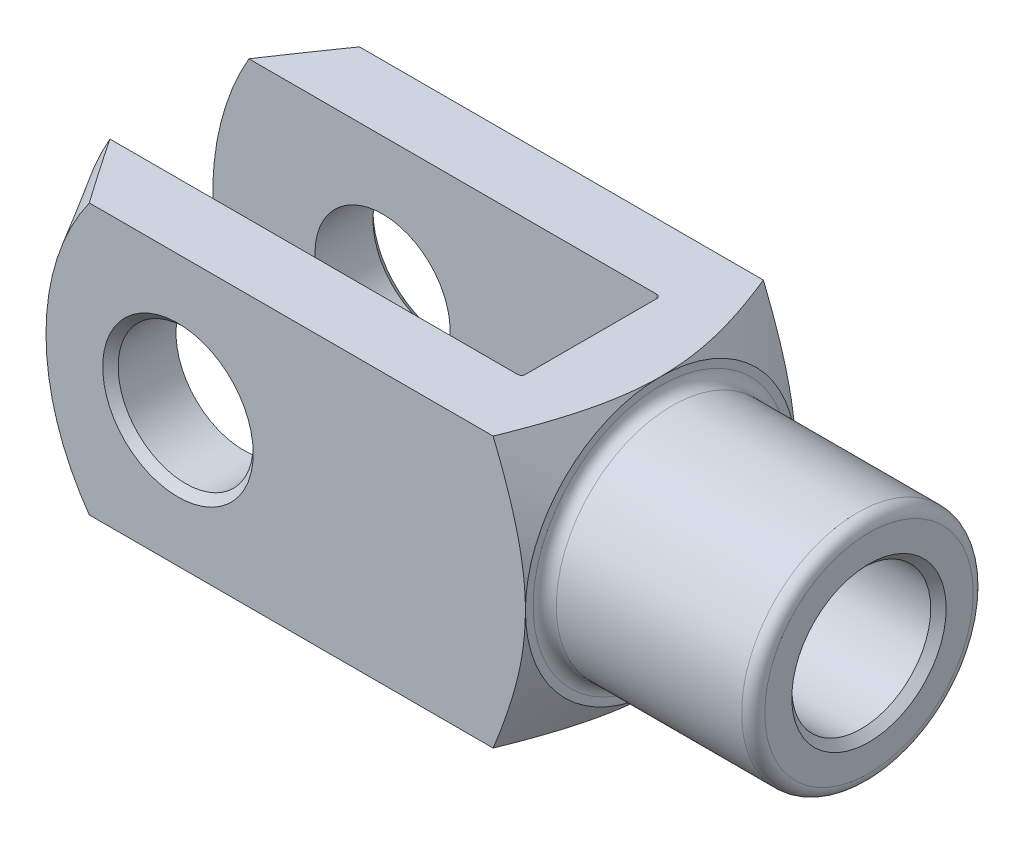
ISO-10303-21;
HEADER;
FILE_DESCRIPTION(('STEP AP214'),'2;1');
FILE_NAME('part.step','',(''),(''),'','','');
FILE_SCHEMA(('AUTOMOTIVE_DESIGN { 1 0 10303 214 1 1 1 1 }'));
ENDSEC;
DATA;
#1=APPLICATION_CONTEXT('core data for automotive mechanical design processes');
#2=APPLICATION_PROTOCOL_DEFINITION('international standard','automotive_design',2000,#1);
#3=PRODUCT_CONTEXT('',#1,'mechanical');
#4=PRODUCT('Part','Part','',(#3));
#5=PRODUCT_RELATED_PRODUCT_CATEGORY('part','',(#4));
#6=PRODUCT_DEFINITION_FORMATION('','',#4);
#7=PRODUCT_DEFINITION_CONTEXT('part definition',#1,'design');
#8=PRODUCT_DEFINITION('design','',#6,#7);
#9=PRODUCT_DEFINITION_SHAPE('','',#8);
#10=(LENGTH_UNIT() NAMED_UNIT(*) SI_UNIT(.MILLI.,.METRE.));
#11=(NAMED_UNIT(*) PLANE_ANGLE_UNIT() SI_UNIT($,.RADIAN.));
#12=(NAMED_UNIT(*) SI_UNIT($,.STERADIAN.) SOLID_ANGLE_UNIT());
#13=UNCERTAINTY_MEASURE_WITH_UNIT(LENGTH_MEASURE(1.E-05),#10,'distance_accuracy_value','');
#14=(GEOMETRIC_REPRESENTATION_CONTEXT(3) GLOBAL_UNCERTAINTY_ASSIGNED_CONTEXT((#13)) GLOBAL_UNIT_ASSIGNED_CONTEXT((#10,
#11,#12)) REPRESENTATION_CONTEXT('',''));
#15=CARTESIAN_POINT('',(0.,0.,0.));
#16=DIRECTION('',(0.,0.,1.));
#17=DIRECTION('',(1.,0.,0.));
#18=AXIS2_PLACEMENT_3D('',#15,#16,#17);
#19=CARTESIAN_POINT('',(-73.,-35.,-17.));
#20=DIRECTION('',(0.,-1.,0.));
#21=DIRECTION('',(0.,0.,-1.));
#22=AXIS2_PLACEMENT_3D('',#19,#20,#21);
#23=CYLINDRICAL_SURFACE('',#22,1.);
#24=DIRECTION('',(0.,1.,0.));
#25=VECTOR('',#24,1.);
#26=CARTESIAN_POINT('',(-72.,-35.,-17.));
#27=LINE('',#26,#25);
#28=CARTESIAN_POINT('',(-72.,-5.91607978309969,-17.));
#29=VERTEX_POINT('',#28);
#30=CARTESIAN_POINT('',(-72.,-35.,-17.));
#31=VERTEX_POINT('',#30);
#32=EDGE_CURVE('E358',#29,#31,#27,.F.);
#33=ORIENTED_EDGE('',*,*,#32,.F.);
#34=CARTESIAN_POINT('',(-72.,-5.91607978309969,-17.));
#35=CARTESIAN_POINT('',(-72.0000059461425,-5.83676482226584,-17.027602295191));
#36=CARTESIAN_POINT('',(-72.0011421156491,-5.75726491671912,-17.0546459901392));
#37=CARTESIAN_POINT('',(-72.0054496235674,-5.59795427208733,-17.107599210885));
#38=CARTESIAN_POINT('',(-72.0086206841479,-5.51814357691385,-17.1335088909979));
#39=CARTESIAN_POINT('',(-72.0208424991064,-5.27842664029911,-17.2094828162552));
#40=CARTESIAN_POINT('',(-72.0326026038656,-5.11811106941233,-17.2578352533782));
#41=CARTESIAN_POINT('',(-72.061952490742,-4.79693886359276,-17.3498486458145));
#42=CARTESIAN_POINT('',(-72.0795340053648,-4.63608331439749,-17.3935161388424));
#43=CARTESIAN_POINT('',(-72.1194913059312,-4.31375067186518,-17.4762482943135));
#44=CARTESIAN_POINT('',(-72.1418684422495,-4.15227341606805,-17.5153116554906));
#45=CARTESIAN_POINT('',(-72.2156020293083,-3.66236952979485,-17.6266927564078));
#46=CARTESIAN_POINT('',(-72.2730770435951,-3.33320164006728,-17.691847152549));
#47=CARTESIAN_POINT('',(-72.3987344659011,-2.67378084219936,-17.8034505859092));
#48=CARTESIAN_POINT('',(-72.4669208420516,-2.34352757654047,-17.849892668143));
#49=CARTESIAN_POINT('',(-72.6814368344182,-1.3515128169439,-17.9615200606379));
#50=CARTESIAN_POINT('',(-72.8377341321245,-0.688435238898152,-17.9990202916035));
#51=CARTESIAN_POINT('',(-72.9958961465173,-0.0174113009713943,-17.9999936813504));
#52=CARTESIAN_POINT('',(-72.9979481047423,-0.00870558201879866,-17.9999999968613));
#53=CARTESIAN_POINT('',(-73.,0.,-18.));
#54=B_SPLINE_CURVE_WITH_KNOTS('',3,(#34,#35,#36,#37,#38,#39,#40,#41,#42,#43,#44,#45,#46,#47,#48,
#49,#50,#51,#52,#53),.UNSPECIFIED.,.F.,.F.,(4,2,2,2,2,2,2,2,2,4),(0.,0.251917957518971,
0.503801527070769,1.00717378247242,1.50983419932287,2.01263634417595,3.03303739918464,
4.05381736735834,6.09518762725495,6.12202044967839),.UNSPECIFIED.);
#55=CARTESIAN_POINT('',(-73.,0.,-18.));
#56=VERTEX_POINT('',#55);
#57=EDGE_CURVE('E390',#29,#56,#54,.T.);
#58=ORIENTED_EDGE('',*,*,#57,.T.);
#59=DIRECTION('',(0.,1.,0.));
#60=VECTOR('',#59,1.);
#61=CARTESIAN_POINT('',(-73.,35.,-18.));
#62=LINE('',#61,#60);
#63=CARTESIAN_POINT('',(-73.,-35.,-18.));
#64=VERTEX_POINT('',#63);
#65=EDGE_CURVE('E183',#64,#56,#62,.T.);
#66=ORIENTED_EDGE('',*,*,#65,.F.);
#67=CARTESIAN_POINT('',(-73.,-35.,-17.));
#68=DIRECTION('',(0.,-1.,0.));
#69=DIRECTION('',(0.,0.,-1.));
#70=AXIS2_PLACEMENT_3D('',#67,#68,#69);
#71=CIRCLE('',#70,1.);
#72=EDGE_CURVE('E198',#31,#64,#71,.F.);
#73=ORIENTED_EDGE('',*,*,#72,.F.);
#74=EDGE_LOOP('',(#33,#58,#66,#73));
#75=FACE_BOUND('',#74,.T.);
#76=ADVANCED_FACE('F37',(#75),#23,.F.);
#77=CARTESIAN_POINT('',(-72.,-35.,-18.));
#78=DIRECTION('',(1.,0.,0.));
#79=DIRECTION('',(0.,0.,-1.));
#80=AXIS2_PLACEMENT_3D('',#77,#78,#79);
#81=PLANE('',#80);
#82=CARTESIAN_POINT('',(-72.,35.,-17.));
#83=VERTEX_POINT('',#82);
#84=CARTESIAN_POINT('',(-72.,5.91607978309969,-17.));
#85=VERTEX_POINT('',#84);
#86=EDGE_CURVE('E374',#83,#85,#27,.F.);
#87=ORIENTED_EDGE('',*,*,#86,.T.);
#88=CARTESIAN_POINT('',(-72.,0.,0.));
#89=DIRECTION('',(1.,0.,0.));
#90=DIRECTION('',(0.,0.,-1.));
#91=AXIS2_PLACEMENT_3D('',#88,#89,#90);
#92=CIRCLE('',#91,18.);
#93=CARTESIAN_POINT('',(-72.,5.91607978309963,17.));
#94=VERTEX_POINT('',#93);
#95=EDGE_CURVE('E429',#85,#94,#92,.T.);
#96=ORIENTED_EDGE('',*,*,#95,.T.);
#97=DIRECTION('',(0.,1.,0.));
#98=VECTOR('',#97,1.);
#99=CARTESIAN_POINT('',(-72.,35.,17.));
#100=LINE('',#99,#98);
#101=CARTESIAN_POINT('',(-72.,35.,17.));
#102=VERTEX_POINT('',#101);
#103=EDGE_CURVE('E160',#94,#102,#100,.T.);
#104=ORIENTED_EDGE('',*,*,#103,.T.);
#105=DIRECTION('',(0.,0.,-1.));
#106=VECTOR('',#105,1.);
#107=CARTESIAN_POINT('',(-72.,35.,-18.));
#108=LINE('',#107,#106);
#109=EDGE_CURVE('E339',#102,#83,#108,.T.);
#110=ORIENTED_EDGE('',*,*,#109,.T.);
#111=EDGE_LOOP('',(#87,#96,#104,#110));
#112=FACE_BOUND('',#111,.T.);
#113=ADVANCED_FACE('F468',(#112),#81,.F.);
#114=CARTESIAN_POINT('',(-73.,-35.,17.));
#115=DIRECTION('',(0.,-1.,0.));
#116=DIRECTION('',(0.,0.,-1.));
#117=AXIS2_PLACEMENT_3D('',#114,#115,#116);
#118=CYLINDRICAL_SURFACE('',#117,1.);
#119=ORIENTED_EDGE('',*,*,#103,.F.);
#120=CARTESIAN_POINT('',(-72.,5.91607978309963,17.));
#121=CARTESIAN_POINT('',(-72.0000059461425,5.8367648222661,17.0276022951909));
#122=CARTESIAN_POINT('',(-72.0011421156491,5.75726491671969,17.0546459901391));
#123=CARTESIAN_POINT('',(-72.0054496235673,5.59795427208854,17.1075992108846));
#124=CARTESIAN_POINT('',(-72.0086206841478,5.51814357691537,17.1335088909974));
#125=CARTESIAN_POINT('',(-72.0208424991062,5.27842664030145,17.2094828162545));
#126=CARTESIAN_POINT('',(-72.0326026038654,5.11811106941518,17.2578352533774));
#127=CARTESIAN_POINT('',(-72.0619524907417,4.7969388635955,17.3498486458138));
#128=CARTESIAN_POINT('',(-72.0795340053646,4.63608331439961,17.3935161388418));
#129=CARTESIAN_POINT('',(-72.1194913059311,4.31375067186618,17.4762482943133));
#130=CARTESIAN_POINT('',(-72.1418684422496,4.15227341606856,17.5153116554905));
#131=CARTESIAN_POINT('',(-72.2156020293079,3.66236952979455,17.6266927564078));
#132=CARTESIAN_POINT('',(-72.2730770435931,3.33320164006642,17.691847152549));
#133=CARTESIAN_POINT('',(-72.3987344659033,2.67378084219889,17.8034505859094));
#134=CARTESIAN_POINT('',(-72.4669208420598,2.34352757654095,17.8498926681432));
#135=CARTESIAN_POINT('',(-72.6814368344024,1.35151281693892,17.9615200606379));
#136=CARTESIAN_POINT('',(-72.8377341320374,0.688435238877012,17.999020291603));
#137=CARTESIAN_POINT('',(-72.995896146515,0.0174113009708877,17.9999936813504));
#138=CARTESIAN_POINT('',(-72.9979481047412,0.00870558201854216,17.9999999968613));
#139=CARTESIAN_POINT('',(-73.,0.,18.));
#140=B_SPLINE_CURVE_WITH_KNOTS('',3,(#120,#121,#122,#123,#124,#125,#126,#127,#128,#129,#130,
#131,#132,#133,#134,#135,#136,#137,#138,#139),.UNSPECIFIED.,.F.,.F.,(4,2,2,2,2,2,2,2,2,4),(0.,
0.251917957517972,0.503801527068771,1.00717378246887,1.50983419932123,2.01263634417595,
3.03303739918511,4.05381736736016,6.09518762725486,6.12202044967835),.UNSPECIFIED.);
#141=CARTESIAN_POINT('',(-73.,0.,18.));
#142=VERTEX_POINT('',#141);
#143=EDGE_CURVE('E145',#94,#142,#140,.T.);
#144=ORIENTED_EDGE('',*,*,#143,.T.);
#145=DIRECTION('',(0.,1.,0.));
#146=VECTOR('',#145,1.);
#147=CARTESIAN_POINT('',(-73.,-35.,18.));
#148=LINE('',#147,#146);
#149=CARTESIAN_POINT('',(-73.,35.,18.));
#150=VERTEX_POINT('',#149);
#151=EDGE_CURVE('E159',#150,#142,#148,.F.);
#152=ORIENTED_EDGE('',*,*,#151,.F.);
#153=CARTESIAN_POINT('',(-73.,35.,17.));
#154=DIRECTION('',(0.,1.,0.));
#155=DIRECTION('',(0.,0.,1.));
#156=AXIS2_PLACEMENT_3D('',#153,#154,#155);
#157=CIRCLE('',#156,1.);
#158=EDGE_CURVE('E190',#102,#150,#157,.F.);
#159=ORIENTED_EDGE('',*,*,#158,.F.);
#160=EDGE_LOOP('',(#119,#144,#152,#159));
#161=FACE_BOUND('',#160,.T.);
#162=ADVANCED_FACE('F156',(#161),#118,.F.);
#163=CARTESIAN_POINT('',(-188.,-35.,-18.));
#164=DIRECTION('',(0.,0.,-1.));
#165=DIRECTION('',(-1.,0.,0.));
#166=AXIS2_PLACEMENT_3D('',#163,#164,#165);
#167=PLANE('',#166);
#168=CARTESIAN_POINT('',(-144.,0.,-18.));
#169=DIRECTION('',(0.,0.,-1.));
#170=DIRECTION('',(-1.,0.,0.));
#171=AXIS2_PLACEMENT_3D('',#168,#169,#170);
#172=CIRCLE('',#171,17.5);
#173=CARTESIAN_POINT('',(-161.5,0.,-18.));
#174=VERTEX_POINT('',#173);
#175=EDGE_CURVE('E368',#174,#174,#172,.F.);
#176=ORIENTED_EDGE('',*,*,#175,.F.);
#177=EDGE_LOOP('',(#176));
#178=FACE_BOUND('',#177,.T.);
#179=CARTESIAN_POINT('',(-118.,0.,-18.));
#180=DIRECTION('',(0.,0.,1.));
#181=DIRECTION('',(1.,0.,0.));
#182=AXIS2_PLACEMENT_3D('',#179,#180,#181);
#183=CIRCLE('',#182,70.);
#184=CARTESIAN_POINT('',(-178.621778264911,35.,-18.));
#185=VERTEX_POINT('',#184);
#186=CARTESIAN_POINT('',(-178.621778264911,-35.,-18.));
#187=VERTEX_POINT('',#186);
#188=EDGE_CURVE('E277',#185,#187,#183,.T.);
#189=ORIENTED_EDGE('',*,*,#188,.T.);
#190=DIRECTION('',(-1.,0.,0.));
#191=VECTOR('',#190,1.);
#192=CARTESIAN_POINT('',(-188.,-35.,-18.));
#193=LINE('',#192,#191);
#194=EDGE_CURVE('E334',#64,#187,#193,.T.);
#195=ORIENTED_EDGE('',*,*,#194,.F.);
#196=ORIENTED_EDGE('',*,*,#65,.T.);
#197=CARTESIAN_POINT('',(-73.,35.,-18.));
#198=VERTEX_POINT('',#197);
#199=EDGE_CURVE('E179',#56,#198,#62,.T.);
#200=ORIENTED_EDGE('',*,*,#199,.T.);
#201=DIRECTION('',(-1.,0.,0.));
#202=VECTOR('',#201,1.);
#203=CARTESIAN_POINT('',(-188.,35.,-18.));
#204=LINE('',#203,#202);
#205=EDGE_CURVE('E347',#198,#185,#204,.T.);
#206=ORIENTED_EDGE('',*,*,#205,.T.);
#207=EDGE_LOOP('',(#189,#195,#196,#200,#206));
#208=FACE_BOUND('',#207,.T.);
#209=ADVANCED_FACE('F393',(#178,#208),#167,.F.);
#210=CARTESIAN_POINT('',(-188.,-35.,18.));
#211=DIRECTION('',(0.,0.,1.));
#212=DIRECTION('',(1.,0.,0.));
#213=AXIS2_PLACEMENT_3D('',#210,#211,#212);
#214=PLANE('',#213);
#215=CARTESIAN_POINT('',(-144.,0.,18.));
#216=DIRECTION('',(0.,0.,1.));
#217=DIRECTION('',(1.,0.,0.));
#218=AXIS2_PLACEMENT_3D('',#215,#216,#217);
#219=CIRCLE('',#218,17.5);
#220=CARTESIAN_POINT('',(-126.5,0.,18.));
#221=VERTEX_POINT('',#220);
#222=EDGE_CURVE('E346',#221,#221,#219,.F.);
#223=ORIENTED_EDGE('',*,*,#222,.F.);
#224=EDGE_LOOP('',(#223));
#225=FACE_BOUND('',#224,.T.);
#226=DIRECTION('',(1.,0.,0.));
#227=VECTOR('',#226,1.);
#228=CARTESIAN_POINT('',(-188.,-35.,18.));
#229=LINE('',#228,#227);
#230=CARTESIAN_POINT('',(-178.621778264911,-35.,18.));
#231=VERTEX_POINT('',#230);
#232=CARTESIAN_POINT('',(-73.,-35.,18.));
#233=VERTEX_POINT('',#232);
#234=EDGE_CURVE('E338',#231,#233,#229,.T.);
#235=ORIENTED_EDGE('',*,*,#234,.F.);
#236=CARTESIAN_POINT('',(-118.,0.,18.));
#237=DIRECTION('',(0.,0.,1.));
#238=DIRECTION('',(1.,0.,0.));
#239=AXIS2_PLACEMENT_3D('',#236,#237,#238);
#240=CIRCLE('',#239,70.);
#241=CARTESIAN_POINT('',(-178.621778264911,35.,18.));
#242=VERTEX_POINT('',#241);
#243=EDGE_CURVE('E418',#242,#231,#240,.T.);
#244=ORIENTED_EDGE('',*,*,#243,.F.);
#245=DIRECTION('',(1.,0.,0.));
#246=VECTOR('',#245,1.);
#247=CARTESIAN_POINT('',(-188.,35.,18.));
#248=LINE('',#247,#246);
#249=EDGE_CURVE('E176',#242,#150,#248,.T.);
#250=ORIENTED_EDGE('',*,*,#249,.T.);
#251=ORIENTED_EDGE('',*,*,#151,.T.);
#252=EDGE_CURVE('E164',#142,#233,#148,.F.);
#253=ORIENTED_EDGE('',*,*,#252,.T.);
#254=EDGE_LOOP('',(#235,#244,#250,#251,#253));
#255=FACE_BOUND('',#254,.T.);
#256=ADVANCED_FACE('F173',(#225,#255),#214,.F.);
#257=CARTESIAN_POINT('',(-188.,-35.,35.));
#258=DIRECTION('',(0.,0.,1.));
#259=DIRECTION('',(1.,0.,0.));
#260=AXIS2_PLACEMENT_3D('',#257,#258,#259);
#261=PLANE('',#260);
#262=CARTESIAN_POINT('',(-144.,0.,35.));
#263=DIRECTION('',(0.,0.,1.));
#264=DIRECTION('',(1.,0.,0.));
#265=AXIS2_PLACEMENT_3D('',#262,#263,#264);
#266=CIRCLE('',#265,19.5);
#267=CARTESIAN_POINT('',(-124.5,0.,35.));
#268=VERTEX_POINT('',#267);
#269=EDGE_CURVE('E229',#268,#268,#266,.F.);
#270=ORIENTED_EDGE('',*,*,#269,.T.);
#271=EDGE_LOOP('',(#270));
#272=FACE_BOUND('',#271,.T.);
#273=DIRECTION('',(1.,0.,0.));
#274=VECTOR('',#273,1.);
#275=CARTESIAN_POINT('',(-188.,35.,35.));
#276=LINE('',#275,#274);
#277=CARTESIAN_POINT('',(-166.961614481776,35.,35.));
#278=VERTEX_POINT('',#277);
#279=CARTESIAN_POINT('',(-62.3701209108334,35.,35.));
#280=VERTEX_POINT('',#279);
#281=EDGE_CURVE('E365',#278,#280,#276,.T.);
#282=ORIENTED_EDGE('',*,*,#281,.F.);
#283=CARTESIAN_POINT('',(-118.,0.,35.));
#284=DIRECTION('',(0.,0.,1.));
#285=DIRECTION('',(1.,0.,0.));
#286=AXIS2_PLACEMENT_3D('',#283,#284,#285);
#287=CIRCLE('',#286,60.1850454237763);
#288=CARTESIAN_POINT('',(-166.961614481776,-35.,35.));
#289=VERTEX_POINT('',#288);
#290=EDGE_CURVE('E61',#278,#289,#287,.T.);
#291=ORIENTED_EDGE('',*,*,#290,.T.);
#292=DIRECTION('',(1.,0.,0.));
#293=VECTOR('',#292,1.);
#294=CARTESIAN_POINT('',(-188.,-35.,35.));
#295=LINE('',#294,#293);
#296=CARTESIAN_POINT('',(-62.3701209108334,-35.,35.));
#297=VERTEX_POINT('',#296);
#298=EDGE_CURVE('E362',#289,#297,#295,.T.);
#299=ORIENTED_EDGE('',*,*,#298,.T.);
#300=CARTESIAN_POINT('',(-79.7455571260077,-71.4841524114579,35.));
#301=CARTESIAN_POINT('',(-79.2983354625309,-70.6216687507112,35.));
#302=CARTESIAN_POINT('',(-78.8523395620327,-69.7585498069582,35.));
#303=CARTESIAN_POINT('',(-77.9630613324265,-68.0309117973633,35.));
#304=CARTESIAN_POINT('',(-77.5197790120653,-67.1663927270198,35.));
#305=CARTESIAN_POINT('',(-76.1943552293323,-64.5704620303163,35.));
#306=CARTESIAN_POINT('',(-75.3166821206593,-62.8367639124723,35.));
#307=CARTESIAN_POINT('',(-73.5744168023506,-59.3590234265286,35.));
#308=CARTESIAN_POINT('',(-72.7098500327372,-57.6149683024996,35.));
#309=CARTESIAN_POINT('',(-70.9988898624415,-54.1179792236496,35.));
#310=CARTESIAN_POINT('',(-70.1524961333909,-52.3650454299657,35.));
#311=CARTESIAN_POINT('',(-68.8743862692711,-49.673396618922,35.));
#312=CARTESIAN_POINT('',(-68.4344483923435,-48.7385836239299,35.));
#313=CARTESIAN_POINT('',(-67.5619188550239,-46.865537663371,35.));
#314=CARTESIAN_POINT('',(-67.1293271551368,-45.9273047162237,35.));
#315=CARTESIAN_POINT('',(-66.2724882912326,-44.0469670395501,35.));
#316=CARTESIAN_POINT('',(-65.8482416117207,-43.1048620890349,35.));
#317=CARTESIAN_POINT('',(-65.0093315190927,-41.2163859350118,35.));
#318=CARTESIAN_POINT('',(-64.594668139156,-40.2700147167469,35.));
#319=CARTESIAN_POINT('',(-63.7765361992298,-38.3729279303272,35.));
#320=CARTESIAN_POINT('',(-63.3730628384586,-37.4222144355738,35.));
#321=CARTESIAN_POINT('',(-62.5788187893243,-35.5154994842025,35.));
#322=CARTESIAN_POINT('',(-62.1880479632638,-34.5594980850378,35.));
#323=CARTESIAN_POINT('',(-61.4212481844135,-32.6417187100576,35.));
#324=CARTESIAN_POINT('',(-61.0452174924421,-31.6799414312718,35.));
#325=CARTESIAN_POINT('',(-60.3101986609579,-29.7498374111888,35.));
#326=CARTESIAN_POINT('',(-59.9512112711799,-28.781510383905,35.));
#327=CARTESIAN_POINT('',(-59.1773660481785,-26.6269700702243,35.));
#328=CARTESIAN_POINT('',(-58.7672704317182,-25.4390360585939,35.));
#329=CARTESIAN_POINT('',(-57.9823694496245,-23.0516177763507,35.));
#330=CARTESIAN_POINT('',(-57.6075610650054,-21.8521345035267,35.));
#331=CARTESIAN_POINT('',(-56.9001918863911,-19.4407071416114,35.));
#332=CARTESIAN_POINT('',(-56.5676302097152,-18.2287633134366,35.));
#333=CARTESIAN_POINT('',(-55.9526962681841,-15.79212691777,35.));
#334=CARTESIAN_POINT('',(-55.6703234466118,-14.5674344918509,35.));
#335=CARTESIAN_POINT('',(-55.1702230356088,-12.1346782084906,35.));
#336=CARTESIAN_POINT('',(-54.9511335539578,-10.926898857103,35.));
#337=CARTESIAN_POINT('',(-54.6702587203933,-9.10791584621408,35.));
#338=CARTESIAN_POINT('',(-54.5845910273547,-8.50034299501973,35.));
#339=CARTESIAN_POINT('',(-54.4300119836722,-7.28307909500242,35.));
#340=CARTESIAN_POINT('',(-54.3610998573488,-6.67338814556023,35.));
#341=CARTESIAN_POINT('',(-54.2408047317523,-5.45265711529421,35.));
#342=CARTESIAN_POINT('',(-54.1894109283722,-4.84161810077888,35.));
#343=CARTESIAN_POINT('',(-54.1046686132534,-3.61828422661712,35.));
#344=CARTESIAN_POINT('',(-54.0713201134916,-3.00598936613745,35.));
#345=CARTESIAN_POINT('',(-54.0230583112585,-1.78068731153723,35.));
#346=CARTESIAN_POINT('',(-54.0081445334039,-1.16768013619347,35.));
#347=CARTESIAN_POINT('',(-53.9969287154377,0.0585026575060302,35.));
#348=CARTESIAN_POINT('',(-54.0006265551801,0.67167827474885,35.));
#349=CARTESIAN_POINT('',(-54.0256414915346,1.85294442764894,35.));
#350=CARTESIAN_POINT('',(-54.0456545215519,2.42106307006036,35.));
#351=CARTESIAN_POINT('',(-54.1014333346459,3.55654632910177,35.));
#352=CARTESIAN_POINT('',(-54.1371997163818,4.12391091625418,35.));
#353=CARTESIAN_POINT('',(-54.2241302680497,5.25742922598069,35.));
#354=CARTESIAN_POINT('',(-54.2752936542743,5.82358300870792,35.));
#355=CARTESIAN_POINT('',(-54.3925261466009,6.95435287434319,35.));
#356=CARTESIAN_POINT('',(-54.4585958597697,7.51896889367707,35.));
#357=CARTESIAN_POINT('',(-54.6783609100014,9.21054236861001,35.));
#358=CARTESIAN_POINT('',(-54.8535756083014,10.3347599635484,35.));
#359=CARTESIAN_POINT('',(-55.2556333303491,12.5738033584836,35.));
#360=CARTESIAN_POINT('',(-55.4824777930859,13.6886288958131,35.));
#361=CARTESIAN_POINT('',(-55.9887006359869,15.94014365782,35.));
#362=CARTESIAN_POINT('',(-56.2694095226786,17.0765317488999,35.));
#363=CARTESIAN_POINT('',(-56.8720367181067,19.3382710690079,35.));
#364=CARTESIAN_POINT('',(-57.1939554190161,20.4636221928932,35.));
#365=CARTESIAN_POINT('',(-57.703069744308,22.1435871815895,35.));
#366=CARTESIAN_POINT('',(-57.8771454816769,22.7022267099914,35.));
#367=CARTESIAN_POINT('',(-58.2333547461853,23.8169352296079,35.));
#368=CARTESIAN_POINT('',(-58.4154882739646,24.3730042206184,35.));
#369=CARTESIAN_POINT('',(-58.7871408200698,25.4826284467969,35.));
#370=CARTESIAN_POINT('',(-58.9766594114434,26.0361838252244,35.));
#371=CARTESIAN_POINT('',(-59.362488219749,27.1409163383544,35.));
#372=CARTESIAN_POINT('',(-59.5587984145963,27.6920934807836,35.));
#373=CARTESIAN_POINT('',(-60.1895678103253,29.4318816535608,35.));
#374=CARTESIAN_POINT('',(-60.6354807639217,30.6163513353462,35.));
#375=CARTESIAN_POINT('',(-61.5515172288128,32.9759195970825,35.));
#376=CARTESIAN_POINT('',(-62.0216421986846,34.1510176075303,35.));
#377=CARTESIAN_POINT('',(-62.982193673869,36.4931780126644,35.));
#378=CARTESIAN_POINT('',(-63.4726247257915,37.6602385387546,35.));
#379=CARTESIAN_POINT('',(-64.4704100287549,39.9870590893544,35.));
#380=CARTESIAN_POINT('',(-64.9777639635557,41.1468192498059,35.));
#381=CARTESIAN_POINT('',(-66.0071895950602,43.4609776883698,35.));
#382=CARTESIAN_POINT('',(-66.5292736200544,44.6153704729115,35.));
#383=CARTESIAN_POINT('',(-67.5855656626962,46.9185930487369,35.));
#384=CARTESIAN_POINT('',(-68.1197737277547,48.0674228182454,35.));
#385=CARTESIAN_POINT('',(-69.1984683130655,50.36008259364,35.));
#386=CARTESIAN_POINT('',(-69.74295366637,51.5039131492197,35.));
#387=CARTESIAN_POINT('',(-70.8407931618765,53.7873038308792,35.));
#388=CARTESIAN_POINT('',(-71.3941472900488,54.9268639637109,35.));
#389=CARTESIAN_POINT('',(-72.5102077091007,57.2056982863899,35.));
#390=CARTESIAN_POINT('',(-73.0729373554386,58.3449610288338,35.));
#391=CARTESIAN_POINT('',(-74.2050779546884,60.620159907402,35.));
#392=CARTESIAN_POINT('',(-74.774488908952,61.7560960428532,35.));
#393=CARTESIAN_POINT('',(-75.919147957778,64.0250497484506,35.));
#394=CARTESIAN_POINT('',(-76.4943961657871,65.1580672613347,35.));
#395=CARTESIAN_POINT('',(-77.6500048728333,67.4214931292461,35.));
#396=CARTESIAN_POINT('',(-78.2303653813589,68.5519014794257,35.));
#397=CARTESIAN_POINT('',(-79.9775989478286,71.9385331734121,35.));
#398=CARTESIAN_POINT('',(-81.151193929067,74.1912896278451,35.));
#399=CARTESIAN_POINT('',(-83.512438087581,78.6893897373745,35.));
#400=CARTESIAN_POINT('',(-84.7000871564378,80.934733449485,35.));
#401=CARTESIAN_POINT('',(-86.9094378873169,85.0864160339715,35.));
#402=CARTESIAN_POINT('',(-87.9295909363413,86.9935796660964,35.));
#403=CARTESIAN_POINT('',(-89.9767304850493,90.8042363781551,35.));
#404=CARTESIAN_POINT('',(-91.0037169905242,92.7077294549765,35.));
#405=CARTESIAN_POINT('',(-93.0635983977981,96.5118602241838,35.));
#406=CARTESIAN_POINT('',(-94.0964941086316,98.4124974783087,35.));
#407=CARTESIAN_POINT('',(-96.1671930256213,102.211097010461,35.));
#408=CARTESIAN_POINT('',(-97.2049962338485,104.109059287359,35.));
#409=CARTESIAN_POINT('',(-99.2788542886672,107.891810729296,35.));
#410=CARTESIAN_POINT('',(-100.314885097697,109.776613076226,35.));
#411=CARTESIAN_POINT('',(-102.390544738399,113.544235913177,35.));
#412=CARTESIAN_POINT('',(-103.430173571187,115.427056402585,35.));
#413=CARTESIAN_POINT('',(-105.51239361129,119.190669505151,35.));
#414=CARTESIAN_POINT('',(-106.55498432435,121.071462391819,35.));
#415=CARTESIAN_POINT('',(-108.642913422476,124.831519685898,35.));
#416=CARTESIAN_POINT('',(-109.68825180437,126.710784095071,35.));
#417=CARTESIAN_POINT('',(-110.734776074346,128.589387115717,35.));
#418=B_SPLINE_CURVE_WITH_KNOTS('',3,(#300,#301,#302,#303,#304,#305,#306,#307,#308,#309,#310,
#311,#312,#313,#314,#315,#316,#317,#318,#319,#320,#321,#322,#323,#324,#325,#326,#327,#328,#329,
#330,#331,#332,#333,#334,#335,#336,#337,#338,#339,#340,#341,#342,#343,#344,#345,#346,#347,#348,
#349,#350,#351,#352,#353,#354,#355,#356,#357,#358,#359,#360,#361,#362,#363,#364,#365,#366,#367,
#368,#369,#370,#371,#372,#373,#374,#375,#376,#377,#378,#379,#380,#381,#382,#383,#384,#385,#386,
#387,#388,#389,#390,#391,#392,#393,#394,#395,#396,#397,#398,#399,#400,#401,#402,#403,#404,#405,
#406,#407,#408,#409,#410,#411,#412,#413,#414,#415,#416,#417),.UNSPECIFIED.,.F.,.F.,(4,2,2,2,2,2,
2,2,2,2,2,2,2,2,2,2,2,2,2,2,2,2,2,2,2,2,2,2,2,2,2,2,2,2,2,2,2,2,2,2,2,2,2,2,2,2,2,2,2,2,2,2,2,2,
2,2,2,2,4),(0.,2.91461071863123,5.82923082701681,11.6587651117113,17.4984507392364,
23.3380307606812,26.437486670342,29.5369259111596,32.6365445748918,35.7361739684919,
38.8344523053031,41.9326970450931,45.0305751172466,48.128589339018,51.8983063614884,
55.6677005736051,59.4370160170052,63.206289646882,66.8870829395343,68.7276372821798,
70.5681064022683,72.4074383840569,74.2467715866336,76.0860573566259,77.9253312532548,
79.6305250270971,81.3357836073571,83.0409554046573,84.7461966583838,88.1580776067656,
91.5700536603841,95.0807863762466,98.5915525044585,100.346902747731,102.102253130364,
103.857502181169,105.6127455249,109.409260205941,113.206003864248,117.003602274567,
120.801129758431,124.601935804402,128.402756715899,132.203148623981,136.003534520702,
139.815498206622,143.627462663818,147.439501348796,151.251547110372,158.871851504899,
166.492097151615,172.980676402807,179.469261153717,185.958756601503,192.448254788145,
198.900579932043,205.352907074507,211.804214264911,218.255514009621),.UNSPECIFIED.);
#419=CARTESIAN_POINT('',(-54.,0.,35.));
#420=VERTEX_POINT('',#419);
#421=EDGE_CURVE('E306',#420,#297,#418,.F.);
#422=ORIENTED_EDGE('',*,*,#421,.F.);
#423=EDGE_CURVE('E304',#280,#420,#418,.F.);
#424=ORIENTED_EDGE('',*,*,#423,.F.);
#425=EDGE_LOOP('',(#282,#291,#299,#422,#424));
#426=FACE_BOUND('',#425,.T.);
#427=ADVANCED_FACE('F288',(#272,#426),#261,.T.);
#428=CARTESIAN_POINT('',(-188.,-35.,35.));
#429=DIRECTION('',(0.,-1.,0.));
#430=DIRECTION('',(0.,0.,-1.));
#431=AXIS2_PLACEMENT_3D('',#428,#429,#430);
#432=PLANE('',#431);
#433=ORIENTED_EDGE('',*,*,#194,.T.);
#434=CARTESIAN_POINT('',(-222.520724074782,-35.,51.671988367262));
#435=CARTESIAN_POINT('',(-221.554576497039,-35.,50.0851805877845));
#436=CARTESIAN_POINT('',(-220.587448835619,-35.,48.4989695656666));
#437=CARTESIAN_POINT('',(-218.651053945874,-35.,45.3278535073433));
#438=CARTESIAN_POINT('',(-217.681786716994,-35.,43.7429484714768));
#439=CARTESIAN_POINT('',(-214.770491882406,-35.,38.9903370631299));
#440=CARTESIAN_POINT('',(-212.824986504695,-35.,35.8247596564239));
#441=CARTESIAN_POINT('',(-208.922714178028,-35.,29.5000306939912));
#442=CARTESIAN_POINT('',(-206.965945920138,-35.,26.3408799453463));
#443=CARTESIAN_POINT('',(-204.020819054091,-35.,21.6083698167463));
#444=CARTESIAN_POINT('',(-203.037449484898,-35.,20.0319053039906));
#445=CARTESIAN_POINT('',(-201.067026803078,-35.,16.8812746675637));
#446=CARTESIAN_POINT('',(-200.079973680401,-35.,15.3071085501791));
#447=CARTESIAN_POINT('',(-197.117103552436,-35.,10.5953823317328));
#448=CARTESIAN_POINT('',(-195.135238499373,-35.,7.46161750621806));
#449=CARTESIAN_POINT('',(-192.147442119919,-35.,2.77053256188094));
#450=CARTESIAN_POINT('',(-191.149011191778,-35.,1.20843284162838));
#451=CARTESIAN_POINT('',(-189.14652995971,-35.,-1.91215980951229));
#452=CARTESIAN_POINT('',(-188.142479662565,-35.,-3.47065274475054));
#453=CARTESIAN_POINT('',(-186.128018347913,-35.,-6.58361608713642));
#454=CARTESIAN_POINT('',(-185.117607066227,-35.,-8.13808632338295));
#455=CARTESIAN_POINT('',(-183.089635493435,-35.,-11.2423595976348));
#456=CARTESIAN_POINT('',(-182.072075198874,-35.,-12.7921626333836));
#457=CARTESIAN_POINT('',(-180.02883490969,-35.,-15.8863865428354));
#458=CARTESIAN_POINT('',(-179.003154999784,-35.,-17.4308074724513));
#459=CARTESIAN_POINT('',(-176.942493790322,-35.,-20.5134279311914));
#460=CARTESIAN_POINT('',(-175.907512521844,-35.,-22.0516274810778));
#461=CARTESIAN_POINT('',(-173.825154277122,-35.,-25.1232323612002));
#462=CARTESIAN_POINT('',(-172.777760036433,-35.,-26.6566259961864));
#463=CARTESIAN_POINT('',(-170.670487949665,-35.,-29.7148010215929));
#464=CARTESIAN_POINT('',(-169.610610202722,-35.,-31.2395824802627));
#465=CARTESIAN_POINT('',(-167.476483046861,-35.,-34.2785157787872));
#466=CARTESIAN_POINT('',(-166.402237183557,-35.,-35.7926701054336));
#467=CARTESIAN_POINT('',(-164.236427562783,-35.,-38.8086156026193));
#468=CARTESIAN_POINT('',(-163.144863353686,-35.,-40.3104064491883));
#469=CARTESIAN_POINT('',(-160.939743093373,-35.,-43.3006083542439));
#470=CARTESIAN_POINT('',(-159.826162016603,-35.,-44.7890010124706));
#471=CARTESIAN_POINT('',(-158.137031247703,-35.,-47.0072239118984));
#472=CARTESIAN_POINT('',(-157.570878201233,-35.,-47.7442155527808));
#473=CARTESIAN_POINT('',(-156.431628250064,-35.,-49.21280898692));
#474=CARTESIAN_POINT('',(-155.858531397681,-35.,-49.9444108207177));
#475=CARTESIAN_POINT('',(-154.704190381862,-35.,-51.4020845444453));
#476=CARTESIAN_POINT('',(-154.122940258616,-35.,-52.1281517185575));
#477=CARTESIAN_POINT('',(-152.951855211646,-35.,-53.5733147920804));
#478=CARTESIAN_POINT('',(-152.362020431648,-35.,-54.2924108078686));
#479=CARTESIAN_POINT('',(-151.17260637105,-35.,-55.7228130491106));
#480=CARTESIAN_POINT('',(-150.573024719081,-35.,-56.4341173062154));
#481=CARTESIAN_POINT('',(-149.363002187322,-35.,-57.8474945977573));
#482=CARTESIAN_POINT('',(-148.752560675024,-35.,-58.5495670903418));
#483=CARTESIAN_POINT('',(-148.136095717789,-35.,-59.246351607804));
#484=B_SPLINE_CURVE_WITH_KNOTS('',3,(#434,#435,#436,#437,#438,#439,#440,#441,#442,#443,#444,
#445,#446,#447,#448,#449,#450,#451,#452,#453,#454,#455,#456,#457,#458,#459,#460,#461,#462,#463,
#464,#465,#466,#467,#468,#469,#470,#471,#472,#473,#474,#475,#476,#477,#478,#479,#480,#481,#482,
#483),.UNSPECIFIED.,.F.,.F.,(4,2,2,2,2,2,2,2,2,2,2,2,2,2,2,2,2,2,2,2,2,2,2,2,4),(0.,
5.57338268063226,11.1467668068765,22.2936237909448,33.4418034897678,39.0158730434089,
44.5899578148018,55.7134821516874,61.2752332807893,66.836977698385,72.3989546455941,
77.9609342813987,83.5228559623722,89.0847590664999,94.655610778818,100.226418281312,
105.795875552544,111.365478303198,116.94182418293,119.729831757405,122.517818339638,
125.307961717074,128.09805843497,130.888844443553,133.679793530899),.UNSPECIFIED.);
#485=CARTESIAN_POINT('',(-166.961614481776,-35.,-35.));
#486=VERTEX_POINT('',#485);
#487=EDGE_CURVE('E276',#187,#486,#484,.T.);
#488=ORIENTED_EDGE('',*,*,#487,.T.);
#489=DIRECTION('',(1.,0.,0.));
#490=VECTOR('',#489,1.);
#491=CARTESIAN_POINT('',(-188.,-35.,-35.));
#492=LINE('',#491,#490);
#493=CARTESIAN_POINT('',(-62.3701209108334,-35.,-35.));
#494=VERTEX_POINT('',#493);
#495=EDGE_CURVE('E359',#486,#494,#492,.T.);
#496=ORIENTED_EDGE('',*,*,#495,.T.);
#497=CARTESIAN_POINT('',(-79.7455571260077,-35.,-71.4841524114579));
#498=CARTESIAN_POINT('',(-79.2983354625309,-35.,-70.6216687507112));
#499=CARTESIAN_POINT('',(-78.8523395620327,-35.,-69.7585498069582));
#500=CARTESIAN_POINT('',(-77.9630613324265,-35.,-68.0309117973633));
#501=CARTESIAN_POINT('',(-77.5197790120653,-35.,-67.1663927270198));
#502=CARTESIAN_POINT('',(-76.1943552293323,-35.,-64.5704620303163));
#503=CARTESIAN_POINT('',(-75.3166821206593,-35.,-62.8367639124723));
#504=CARTESIAN_POINT('',(-73.5744168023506,-35.,-59.3590234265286));
#505=CARTESIAN_POINT('',(-72.7098500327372,-35.,-57.6149683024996));
#506=CARTESIAN_POINT('',(-70.9988898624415,-35.,-54.1179792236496));
#507=CARTESIAN_POINT('',(-70.1524961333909,-35.,-52.3650454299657));
#508=CARTESIAN_POINT('',(-68.8743862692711,-35.,-49.673396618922));
#509=CARTESIAN_POINT('',(-68.4344483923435,-35.,-48.7385836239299));
#510=CARTESIAN_POINT('',(-67.5619188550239,-35.,-46.865537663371));
#511=CARTESIAN_POINT('',(-67.1293271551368,-35.,-45.9273047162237));
#512=CARTESIAN_POINT('',(-66.2724882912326,-35.,-44.0469670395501));
#513=CARTESIAN_POINT('',(-65.8482416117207,-35.,-43.1048620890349));
#514=CARTESIAN_POINT('',(-65.0093315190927,-35.,-41.2163859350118));
#515=CARTESIAN_POINT('',(-64.594668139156,-35.,-40.2700147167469));
#516=CARTESIAN_POINT('',(-63.7765361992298,-35.,-38.3729279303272));
#517=CARTESIAN_POINT('',(-63.3730628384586,-35.,-37.4222144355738));
#518=CARTESIAN_POINT('',(-62.5788187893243,-35.,-35.5154994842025));
#519=CARTESIAN_POINT('',(-62.1880479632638,-35.,-34.5594980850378));
#520=CARTESIAN_POINT('',(-61.4212481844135,-35.,-32.6417187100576));
#521=CARTESIAN_POINT('',(-61.0452174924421,-35.,-31.6799414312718));
#522=CARTESIAN_POINT('',(-60.3101986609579,-35.,-29.7498374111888));
#523=CARTESIAN_POINT('',(-59.9512112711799,-35.,-28.781510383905));
#524=CARTESIAN_POINT('',(-59.1773660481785,-35.,-26.6269700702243));
#525=CARTESIAN_POINT('',(-58.7672704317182,-35.,-25.4390360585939));
#526=CARTESIAN_POINT('',(-57.9823694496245,-35.,-23.0516177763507));
#527=CARTESIAN_POINT('',(-57.6075610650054,-35.,-21.8521345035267));
#528=CARTESIAN_POINT('',(-56.9001918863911,-35.,-19.4407071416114));
#529=CARTESIAN_POINT('',(-56.5676302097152,-35.,-18.2287633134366));
#530=CARTESIAN_POINT('',(-55.9526962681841,-35.,-15.79212691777));
#531=CARTESIAN_POINT('',(-55.6703234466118,-35.,-14.5674344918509));
#532=CARTESIAN_POINT('',(-55.1702230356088,-35.,-12.1346782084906));
#533=CARTESIAN_POINT('',(-54.9511335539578,-35.,-10.926898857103));
#534=CARTESIAN_POINT('',(-54.6702587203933,-35.,-9.10791584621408));
#535=CARTESIAN_POINT('',(-54.5845910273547,-35.,-8.50034299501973));
#536=CARTESIAN_POINT('',(-54.4300119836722,-35.,-7.28307909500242));
#537=CARTESIAN_POINT('',(-54.3610998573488,-35.,-6.67338814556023));
#538=CARTESIAN_POINT('',(-54.2408047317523,-35.,-5.45265711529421));
#539=CARTESIAN_POINT('',(-54.1894109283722,-35.,-4.84161810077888));
#540=CARTESIAN_POINT('',(-54.1046686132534,-35.,-3.61828422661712));
#541=CARTESIAN_POINT('',(-54.0713201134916,-35.,-3.00598936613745));
#542=CARTESIAN_POINT('',(-54.0230583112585,-35.,-1.78068731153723));
#543=CARTESIAN_POINT('',(-54.0081445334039,-35.,-1.16768013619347));
#544=CARTESIAN_POINT('',(-53.9969287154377,-35.,0.0585026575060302));
#545=CARTESIAN_POINT('',(-54.0006265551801,-35.,0.67167827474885));
#546=CARTESIAN_POINT('',(-54.0256414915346,-35.,1.85294442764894));
#547=CARTESIAN_POINT('',(-54.0456545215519,-35.,2.42106307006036));
#548=CARTESIAN_POINT('',(-54.1014333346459,-35.,3.55654632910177));
#549=CARTESIAN_POINT('',(-54.1371997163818,-35.,4.12391091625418));
#550=CARTESIAN_POINT('',(-54.2241302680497,-35.,5.25742922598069));
#551=CARTESIAN_POINT('',(-54.2752936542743,-35.,5.82358300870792));
#552=CARTESIAN_POINT('',(-54.3925261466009,-35.,6.95435287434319));
#553=CARTESIAN_POINT('',(-54.4585958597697,-35.,7.51896889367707));
#554=CARTESIAN_POINT('',(-54.6783609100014,-35.,9.21054236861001));
#555=CARTESIAN_POINT('',(-54.8535756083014,-35.,10.3347599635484));
#556=CARTESIAN_POINT('',(-55.2556333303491,-35.,12.5738033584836));
#557=CARTESIAN_POINT('',(-55.4824777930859,-35.,13.6886288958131));
#558=CARTESIAN_POINT('',(-55.9887006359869,-35.,15.94014365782));
#559=CARTESIAN_POINT('',(-56.2694095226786,-35.,17.0765317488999));
#560=CARTESIAN_POINT('',(-56.8720367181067,-35.,19.3382710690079));
#561=CARTESIAN_POINT('',(-57.1939554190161,-35.,20.4636221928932));
#562=CARTESIAN_POINT('',(-57.703069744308,-35.,22.1435871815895));
#563=CARTESIAN_POINT('',(-57.8771454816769,-35.,22.7022267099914));
#564=CARTESIAN_POINT('',(-58.2333547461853,-35.,23.8169352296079));
#565=CARTESIAN_POINT('',(-58.4154882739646,-35.,24.3730042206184));
#566=CARTESIAN_POINT('',(-58.7871408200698,-35.,25.4826284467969));
#567=CARTESIAN_POINT('',(-58.9766594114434,-35.,26.0361838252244));
#568=CARTESIAN_POINT('',(-59.362488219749,-35.,27.1409163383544));
#569=CARTESIAN_POINT('',(-59.5587984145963,-35.,27.6920934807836));
#570=CARTESIAN_POINT('',(-60.1895678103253,-35.,29.4318816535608));
#571=CARTESIAN_POINT('',(-60.6354807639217,-35.,30.6163513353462));
#572=CARTESIAN_POINT('',(-61.5515172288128,-35.,32.9759195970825));
#573=CARTESIAN_POINT('',(-62.0216421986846,-35.,34.1510176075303));
#574=CARTESIAN_POINT('',(-62.982193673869,-35.,36.4931780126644));
#575=CARTESIAN_POINT('',(-63.4726247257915,-35.,37.6602385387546));
#576=CARTESIAN_POINT('',(-64.4704100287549,-35.,39.9870590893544));
#577=CARTESIAN_POINT('',(-64.9777639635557,-35.,41.1468192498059));
#578=CARTESIAN_POINT('',(-66.0071895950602,-35.,43.4609776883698));
#579=CARTESIAN_POINT('',(-66.5292736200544,-35.,44.6153704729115));
#580=CARTESIAN_POINT('',(-67.5855656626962,-35.,46.9185930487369));
#581=CARTESIAN_POINT('',(-68.1197737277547,-35.,48.0674228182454));
#582=CARTESIAN_POINT('',(-69.1984683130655,-35.,50.36008259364));
#583=CARTESIAN_POINT('',(-69.74295366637,-35.,51.5039131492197));
#584=CARTESIAN_POINT('',(-70.8407931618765,-35.,53.7873038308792));
#585=CARTESIAN_POINT('',(-71.3941472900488,-35.,54.9268639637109));
#586=CARTESIAN_POINT('',(-72.5102077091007,-35.,57.2056982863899));
#587=CARTESIAN_POINT('',(-73.0729373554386,-35.,58.3449610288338));
#588=CARTESIAN_POINT('',(-74.2050779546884,-35.,60.620159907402));
#589=CARTESIAN_POINT('',(-74.774488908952,-35.,61.7560960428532));
#590=CARTESIAN_POINT('',(-75.919147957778,-35.,64.0250497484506));
#591=CARTESIAN_POINT('',(-76.4943961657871,-35.,65.1580672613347));
#592=CARTESIAN_POINT('',(-77.6500048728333,-35.,67.4214931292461));
#593=CARTESIAN_POINT('',(-78.2303653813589,-35.,68.5519014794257));
#594=CARTESIAN_POINT('',(-79.9775989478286,-35.,71.9385331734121));
#595=CARTESIAN_POINT('',(-81.151193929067,-35.,74.1912896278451));
#596=CARTESIAN_POINT('',(-83.512438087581,-35.,78.6893897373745));
#597=CARTESIAN_POINT('',(-84.7000871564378,-35.,80.934733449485));
#598=CARTESIAN_POINT('',(-86.9094378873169,-35.,85.0864160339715));
#599=CARTESIAN_POINT('',(-87.9295909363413,-35.,86.9935796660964));
#600=CARTESIAN_POINT('',(-89.9767304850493,-35.,90.8042363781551));
#601=CARTESIAN_POINT('',(-91.0037169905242,-35.,92.7077294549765));
#602=CARTESIAN_POINT('',(-93.0635983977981,-35.,96.5118602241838));
#603=CARTESIAN_POINT('',(-94.0964941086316,-35.,98.4124974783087));
#604=CARTESIAN_POINT('',(-96.1671930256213,-35.,102.211097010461));
#605=CARTESIAN_POINT('',(-97.2049962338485,-35.,104.109059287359));
#606=CARTESIAN_POINT('',(-99.2788542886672,-35.,107.891810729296));
#607=CARTESIAN_POINT('',(-100.314885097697,-35.,109.776613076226));
#608=CARTESIAN_POINT('',(-102.390544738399,-35.,113.544235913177));
#609=CARTESIAN_POINT('',(-103.430173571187,-35.,115.427056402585));
#610=CARTESIAN_POINT('',(-105.51239361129,-35.,119.190669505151));
#611=CARTESIAN_POINT('',(-106.55498432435,-35.,121.071462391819));
#612=CARTESIAN_POINT('',(-108.642913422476,-35.,124.831519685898));
#613=CARTESIAN_POINT('',(-109.68825180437,-35.,126.710784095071));
#614=CARTESIAN_POINT('',(-110.734776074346,-35.,128.589387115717));
#615=B_SPLINE_CURVE_WITH_KNOTS('',3,(#497,#498,#499,#500,#501,#502,#503,#504,#505,#506,#507,
#508,#509,#510,#511,#512,#513,#514,#515,#516,#517,#518,#519,#520,#521,#522,#523,#524,#525,#526,
#527,#528,#529,#530,#531,#532,#533,#534,#535,#536,#537,#538,#539,#540,#541,#542,#543,#544,#545,
#546,#547,#548,#549,#550,#551,#552,#553,#554,#555,#556,#557,#558,#559,#560,#561,#562,#563,#564,
#565,#566,#567,#568,#569,#570,#571,#572,#573,#574,#575,#576,#577,#578,#579,#580,#581,#582,#583,
#584,#585,#586,#587,#588,#589,#590,#591,#592,#593,#594,#595,#596,#597,#598,#599,#600,#601,#602,
#603,#604,#605,#606,#607,#608,#609,#610,#611,#612,#613,#614),.UNSPECIFIED.,.F.,.F.,(4,2,2,2,2,2,
2,2,2,2,2,2,2,2,2,2,2,2,2,2,2,2,2,2,2,2,2,2,2,2,2,2,2,2,2,2,2,2,2,2,2,2,2,2,2,2,2,2,2,2,2,2,2,2,
2,2,2,2,4),(0.,2.91461071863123,5.82923082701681,11.6587651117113,17.4984507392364,
23.3380307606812,26.437486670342,29.5369259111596,32.6365445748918,35.7361739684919,
38.8344523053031,41.9326970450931,45.0305751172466,48.128589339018,51.8983063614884,
55.6677005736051,59.4370160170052,63.206289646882,66.8870829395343,68.7276372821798,
70.5681064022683,72.4074383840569,74.2467715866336,76.0860573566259,77.9253312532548,
79.6305250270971,81.3357836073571,83.0409554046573,84.7461966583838,88.1580776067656,
91.5700536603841,95.0807863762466,98.5915525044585,100.346902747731,102.102253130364,
103.857502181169,105.6127455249,109.409260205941,113.206003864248,117.003602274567,
120.801129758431,124.601935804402,128.402756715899,132.203148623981,136.003534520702,
139.815498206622,143.627462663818,147.439501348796,151.251547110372,158.871851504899,
166.492097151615,172.980676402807,179.469261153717,185.958756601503,192.448254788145,
198.900579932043,205.352907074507,211.804214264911,218.255514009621),.UNSPECIFIED.);
#616=CARTESIAN_POINT('',(-54.,-35.,0.));
#617=VERTEX_POINT('',#616);
#618=EDGE_CURVE('E305',#617,#494,#615,.F.);
#619=ORIENTED_EDGE('',*,*,#618,.F.);
#620=EDGE_CURVE('E296',#297,#617,#615,.F.);
#621=ORIENTED_EDGE('',*,*,#620,.F.);
#622=ORIENTED_EDGE('',*,*,#298,.F.);
#623=CARTESIAN_POINT('',(-148.136095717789,-35.,59.2463516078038));
#624=CARTESIAN_POINT('',(-148.752560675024,-35.,58.5495670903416));
#625=CARTESIAN_POINT('',(-149.363002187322,-35.,57.8474945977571));
#626=CARTESIAN_POINT('',(-150.573024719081,-35.,56.4341173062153));
#627=CARTESIAN_POINT('',(-151.17260637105,-35.,55.7228130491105));
#628=CARTESIAN_POINT('',(-152.362020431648,-35.,54.2924108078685));
#629=CARTESIAN_POINT('',(-152.951855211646,-35.,53.5733147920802));
#630=CARTESIAN_POINT('',(-154.122940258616,-35.,52.1281517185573));
#631=CARTESIAN_POINT('',(-154.704190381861,-35.,51.4020845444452));
#632=CARTESIAN_POINT('',(-155.858531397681,-35.,49.9444108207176));
#633=CARTESIAN_POINT('',(-156.431628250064,-35.,49.2128089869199));
#634=CARTESIAN_POINT('',(-157.570878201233,-35.,47.7442155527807));
#635=CARTESIAN_POINT('',(-158.137031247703,-35.,47.0072239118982));
#636=CARTESIAN_POINT('',(-159.826162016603,-35.,44.7890010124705));
#637=CARTESIAN_POINT('',(-160.939743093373,-35.,43.3006083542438));
#638=CARTESIAN_POINT('',(-163.144863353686,-35.,40.3104064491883));
#639=CARTESIAN_POINT('',(-164.236427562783,-35.,38.8086156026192));
#640=CARTESIAN_POINT('',(-166.402237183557,-35.,35.7926701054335));
#641=CARTESIAN_POINT('',(-167.476483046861,-35.,34.2785157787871));
#642=CARTESIAN_POINT('',(-169.610610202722,-35.,31.2395824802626));
#643=CARTESIAN_POINT('',(-170.670487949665,-35.,29.7148010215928));
#644=CARTESIAN_POINT('',(-172.777760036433,-35.,26.6566259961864));
#645=CARTESIAN_POINT('',(-173.825154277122,-35.,25.1232323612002));
#646=CARTESIAN_POINT('',(-175.907512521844,-35.,22.0516274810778));
#647=CARTESIAN_POINT('',(-176.942493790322,-35.,20.5134279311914));
#648=CARTESIAN_POINT('',(-179.003154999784,-35.,17.4308074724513));
#649=CARTESIAN_POINT('',(-180.02883490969,-35.,15.8863865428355));
#650=CARTESIAN_POINT('',(-182.072075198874,-35.,12.7921626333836));
#651=CARTESIAN_POINT('',(-183.089635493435,-35.,11.2423595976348));
#652=CARTESIAN_POINT('',(-185.117607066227,-35.,8.13808632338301));
#653=CARTESIAN_POINT('',(-186.128018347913,-35.,6.58361608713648));
#654=CARTESIAN_POINT('',(-188.142479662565,-35.,3.47065274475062));
#655=CARTESIAN_POINT('',(-189.14652995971,-35.,1.91215980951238));
#656=CARTESIAN_POINT('',(-191.149011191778,-35.,-1.20843284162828));
#657=CARTESIAN_POINT('',(-192.147442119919,-35.,-2.77053256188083));
#658=CARTESIAN_POINT('',(-195.135238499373,-35.,-7.46161750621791));
#659=CARTESIAN_POINT('',(-197.117103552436,-35.,-10.5953823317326));
#660=CARTESIAN_POINT('',(-200.079973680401,-35.,-15.307108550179));
#661=CARTESIAN_POINT('',(-201.067026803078,-35.,-16.8812746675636));
#662=CARTESIAN_POINT('',(-203.037449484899,-35.,-20.0319053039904));
#663=CARTESIAN_POINT('',(-204.020819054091,-35.,-21.6083698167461));
#664=CARTESIAN_POINT('',(-206.965945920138,-35.,-26.3408799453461));
#665=CARTESIAN_POINT('',(-208.922714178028,-35.,-29.5000306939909));
#666=CARTESIAN_POINT('',(-212.824986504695,-35.,-35.8247596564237));
#667=CARTESIAN_POINT('',(-214.770491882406,-35.,-38.9903370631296));
#668=CARTESIAN_POINT('',(-217.681786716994,-35.,-43.7429484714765));
#669=CARTESIAN_POINT('',(-218.651053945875,-35.,-45.327853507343));
#670=CARTESIAN_POINT('',(-220.58744883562,-35.,-48.4989695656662));
#671=CARTESIAN_POINT('',(-221.554576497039,-35.,-50.0851805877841));
#672=CARTESIAN_POINT('',(-222.520724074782,-35.,-51.6719883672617));
#673=B_SPLINE_CURVE_WITH_KNOTS('',3,(#623,#624,#625,#626,#627,#628,#629,#630,#631,#632,#633,
#634,#635,#636,#637,#638,#639,#640,#641,#642,#643,#644,#645,#646,#647,#648,#649,#650,#651,#652,
#653,#654,#655,#656,#657,#658,#659,#660,#661,#662,#663,#664,#665,#666,#667,#668,#669,#670,#671,
#672),.UNSPECIFIED.,.F.,.F.,(4,2,2,2,2,2,2,2,2,2,2,2,2,2,2,2,2,2,2,2,2,2,2,2,4),(0.,
2.79094908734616,5.5817350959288,8.37183181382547,11.1619751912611,13.949961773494,
16.7379693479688,22.3143152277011,27.8839179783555,33.4533752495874,39.024182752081,
44.5950344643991,50.1569375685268,55.7188592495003,61.2808388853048,66.842815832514,
72.4045602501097,77.9663113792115,89.0898357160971,94.66392048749,100.237990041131,
111.386169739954,122.533026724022,128.106410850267,133.679793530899),.UNSPECIFIED.);
#674=EDGE_CURVE('E267',#289,#231,#673,.T.);
#675=ORIENTED_EDGE('',*,*,#674,.T.);
#676=ORIENTED_EDGE('',*,*,#234,.T.);
#677=CARTESIAN_POINT('',(-73.,-35.,17.));
#678=DIRECTION('',(0.,-1.,0.));
#679=DIRECTION('',(0.,0.,-1.));
#680=AXIS2_PLACEMENT_3D('',#677,#678,#679);
#681=CIRCLE('',#680,1.);
#682=CARTESIAN_POINT('',(-72.,-35.,17.));
#683=VERTEX_POINT('',#682);
#684=EDGE_CURVE('E166',#233,#683,#681,.F.);
#685=ORIENTED_EDGE('',*,*,#684,.T.);
#686=DIRECTION('',(0.,0.,-1.));
#687=VECTOR('',#686,1.);
#688=CARTESIAN_POINT('',(-72.,-35.,-18.));
#689=LINE('',#688,#687);
#690=EDGE_CURVE('E342',#683,#31,#689,.T.);
#691=ORIENTED_EDGE('',*,*,#690,.T.);
#692=ORIENTED_EDGE('',*,*,#72,.T.);
#693=EDGE_LOOP('',(#433,#488,#496,#619,#621,#622,#675,#676,#685,#691,#692));
#694=FACE_BOUND('',#693,.T.);
#695=ADVANCED_FACE('F283',(#694),#432,.T.);
#696=CARTESIAN_POINT('',(-188.,-35.,-35.));
#697=DIRECTION('',(0.,0.,-1.));
#698=DIRECTION('',(-1.,0.,0.));
#699=AXIS2_PLACEMENT_3D('',#696,#697,#698);
#700=PLANE('',#699);
#701=CARTESIAN_POINT('',(-144.,0.,-35.));
#702=DIRECTION('',(0.,0.,-1.));
#703=DIRECTION('',(-1.,0.,0.));
#704=AXIS2_PLACEMENT_3D('',#701,#702,#703);
#705=CIRCLE('',#704,19.5);
#706=CARTESIAN_POINT('',(-163.5,0.,-35.));
#707=VERTEX_POINT('',#706);
#708=EDGE_CURVE('E217',#707,#707,#705,.F.);
#709=ORIENTED_EDGE('',*,*,#708,.T.);
#710=EDGE_LOOP('',(#709));
#711=FACE_BOUND('',#710,.T.);
#712=ORIENTED_EDGE('',*,*,#495,.F.);
#713=CARTESIAN_POINT('',(-118.,0.,-35.));
#714=DIRECTION('',(0.,0.,1.));
#715=DIRECTION('',(1.,0.,0.));
#716=AXIS2_PLACEMENT_3D('',#713,#714,#715);
#717=CIRCLE('',#716,60.1850454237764);
#718=CARTESIAN_POINT('',(-166.961614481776,35.,-35.));
#719=VERTEX_POINT('',#718);
#720=EDGE_CURVE('E406',#719,#486,#717,.T.);
#721=ORIENTED_EDGE('',*,*,#720,.F.);
#722=DIRECTION('',(1.,0.,0.));
#723=VECTOR('',#722,1.);
#724=CARTESIAN_POINT('',(-188.,35.,-35.));
#725=LINE('',#724,#723);
#726=CARTESIAN_POINT('',(-62.3701209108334,35.,-35.));
#727=VERTEX_POINT('',#726);
#728=EDGE_CURVE('E355',#719,#727,#725,.T.);
#729=ORIENTED_EDGE('',*,*,#728,.T.);
#730=CARTESIAN_POINT('',(-79.7455571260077,-71.4841524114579,-35.));
#731=CARTESIAN_POINT('',(-79.2983354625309,-70.6216687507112,-35.));
#732=CARTESIAN_POINT('',(-78.8523395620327,-69.7585498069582,-35.));
#733=CARTESIAN_POINT('',(-77.9630613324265,-68.0309117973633,-35.));
#734=CARTESIAN_POINT('',(-77.5197790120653,-67.1663927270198,-35.));
#735=CARTESIAN_POINT('',(-76.1943552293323,-64.5704620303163,-35.));
#736=CARTESIAN_POINT('',(-75.3166821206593,-62.8367639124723,-35.));
#737=CARTESIAN_POINT('',(-73.5744168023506,-59.3590234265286,-35.));
#738=CARTESIAN_POINT('',(-72.7098500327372,-57.6149683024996,-35.));
#739=CARTESIAN_POINT('',(-70.9988898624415,-54.1179792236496,-35.));
#740=CARTESIAN_POINT('',(-70.1524961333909,-52.3650454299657,-35.));
#741=CARTESIAN_POINT('',(-68.8743862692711,-49.673396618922,-35.));
#742=CARTESIAN_POINT('',(-68.4344483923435,-48.7385836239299,-35.));
#743=CARTESIAN_POINT('',(-67.5619188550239,-46.865537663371,-35.));
#744=CARTESIAN_POINT('',(-67.1293271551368,-45.9273047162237,-35.));
#745=CARTESIAN_POINT('',(-66.2724882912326,-44.0469670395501,-35.));
#746=CARTESIAN_POINT('',(-65.8482416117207,-43.1048620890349,-35.));
#747=CARTESIAN_POINT('',(-65.0093315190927,-41.2163859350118,-35.));
#748=CARTESIAN_POINT('',(-64.594668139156,-40.2700147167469,-35.));
#749=CARTESIAN_POINT('',(-63.7765361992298,-38.3729279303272,-35.));
#750=CARTESIAN_POINT('',(-63.3730628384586,-37.4222144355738,-35.));
#751=CARTESIAN_POINT('',(-62.5788187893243,-35.5154994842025,-35.));
#752=CARTESIAN_POINT('',(-62.1880479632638,-34.5594980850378,-35.));
#753=CARTESIAN_POINT('',(-61.4212481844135,-32.6417187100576,-35.));
#754=CARTESIAN_POINT('',(-61.0452174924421,-31.6799414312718,-35.));
#755=CARTESIAN_POINT('',(-60.3101986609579,-29.7498374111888,-35.));
#756=CARTESIAN_POINT('',(-59.9512112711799,-28.781510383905,-35.));
#757=CARTESIAN_POINT('',(-59.1773660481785,-26.6269700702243,-35.));
#758=CARTESIAN_POINT('',(-58.7672704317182,-25.4390360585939,-35.));
#759=CARTESIAN_POINT('',(-57.9823694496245,-23.0516177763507,-35.));
#760=CARTESIAN_POINT('',(-57.6075610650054,-21.8521345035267,-35.));
#761=CARTESIAN_POINT('',(-56.9001918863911,-19.4407071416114,-35.));
#762=CARTESIAN_POINT('',(-56.5676302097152,-18.2287633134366,-35.));
#763=CARTESIAN_POINT('',(-55.9526962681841,-15.79212691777,-35.));
#764=CARTESIAN_POINT('',(-55.6703234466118,-14.5674344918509,-35.));
#765=CARTESIAN_POINT('',(-55.1702230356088,-12.1346782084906,-35.));
#766=CARTESIAN_POINT('',(-54.9511335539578,-10.926898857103,-35.));
#767=CARTESIAN_POINT('',(-54.6702587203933,-9.10791584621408,-35.));
#768=CARTESIAN_POINT('',(-54.5845910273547,-8.50034299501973,-35.));
#769=CARTESIAN_POINT('',(-54.4300119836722,-7.28307909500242,-35.));
#770=CARTESIAN_POINT('',(-54.3610998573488,-6.67338814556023,-35.));
#771=CARTESIAN_POINT('',(-54.2408047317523,-5.45265711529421,-35.));
#772=CARTESIAN_POINT('',(-54.1894109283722,-4.84161810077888,-35.));
#773=CARTESIAN_POINT('',(-54.1046686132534,-3.61828422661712,-35.));
#774=CARTESIAN_POINT('',(-54.0713201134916,-3.00598936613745,-35.));
#775=CARTESIAN_POINT('',(-54.0230583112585,-1.78068731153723,-35.));
#776=CARTESIAN_POINT('',(-54.0081445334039,-1.16768013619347,-35.));
#777=CARTESIAN_POINT('',(-53.9969287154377,0.0585026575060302,-35.));
#778=CARTESIAN_POINT('',(-54.0006265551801,0.67167827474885,-35.));
#779=CARTESIAN_POINT('',(-54.0256414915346,1.85294442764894,-35.));
#780=CARTESIAN_POINT('',(-54.0456545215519,2.42106307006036,-35.));
#781=CARTESIAN_POINT('',(-54.1014333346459,3.55654632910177,-35.));
#782=CARTESIAN_POINT('',(-54.1371997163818,4.12391091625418,-35.));
#783=CARTESIAN_POINT('',(-54.2241302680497,5.25742922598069,-35.));
#784=CARTESIAN_POINT('',(-54.2752936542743,5.82358300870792,-35.));
#785=CARTESIAN_POINT('',(-54.3925261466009,6.95435287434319,-35.));
#786=CARTESIAN_POINT('',(-54.4585958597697,7.51896889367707,-35.));
#787=CARTESIAN_POINT('',(-54.6783609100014,9.21054236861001,-35.));
#788=CARTESIAN_POINT('',(-54.8535756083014,10.3347599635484,-35.));
#789=CARTESIAN_POINT('',(-55.2556333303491,12.5738033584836,-35.));
#790=CARTESIAN_POINT('',(-55.4824777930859,13.6886288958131,-35.));
#791=CARTESIAN_POINT('',(-55.9887006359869,15.94014365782,-35.));
#792=CARTESIAN_POINT('',(-56.2694095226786,17.0765317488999,-35.));
#793=CARTESIAN_POINT('',(-56.8720367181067,19.3382710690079,-35.));
#794=CARTESIAN_POINT('',(-57.1939554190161,20.4636221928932,-35.));
#795=CARTESIAN_POINT('',(-57.703069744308,22.1435871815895,-35.));
#796=CARTESIAN_POINT('',(-57.8771454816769,22.7022267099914,-35.));
#797=CARTESIAN_POINT('',(-58.2333547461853,23.8169352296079,-35.));
#798=CARTESIAN_POINT('',(-58.4154882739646,24.3730042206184,-35.));
#799=CARTESIAN_POINT('',(-58.7871408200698,25.4826284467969,-35.));
#800=CARTESIAN_POINT('',(-58.9766594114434,26.0361838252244,-35.));
#801=CARTESIAN_POINT('',(-59.362488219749,27.1409163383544,-35.));
#802=CARTESIAN_POINT('',(-59.5587984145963,27.6920934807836,-35.));
#803=CARTESIAN_POINT('',(-60.1895678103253,29.4318816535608,-35.));
#804=CARTESIAN_POINT('',(-60.6354807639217,30.6163513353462,-35.));
#805=CARTESIAN_POINT('',(-61.5515172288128,32.9759195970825,-35.));
#806=CARTESIAN_POINT('',(-62.0216421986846,34.1510176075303,-35.));
#807=CARTESIAN_POINT('',(-62.982193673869,36.4931780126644,-35.));
#808=CARTESIAN_POINT('',(-63.4726247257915,37.6602385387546,-35.));
#809=CARTESIAN_POINT('',(-64.4704100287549,39.9870590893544,-35.));
#810=CARTESIAN_POINT('',(-64.9777639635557,41.1468192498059,-35.));
#811=CARTESIAN_POINT('',(-66.0071895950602,43.4609776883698,-35.));
#812=CARTESIAN_POINT('',(-66.5292736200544,44.6153704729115,-35.));
#813=CARTESIAN_POINT('',(-67.5855656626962,46.9185930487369,-35.));
#814=CARTESIAN_POINT('',(-68.1197737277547,48.0674228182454,-35.));
#815=CARTESIAN_POINT('',(-69.1984683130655,50.36008259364,-35.));
#816=CARTESIAN_POINT('',(-69.74295366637,51.5039131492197,-35.));
#817=CARTESIAN_POINT('',(-70.8407931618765,53.7873038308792,-35.));
#818=CARTESIAN_POINT('',(-71.3941472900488,54.9268639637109,-35.));
#819=CARTESIAN_POINT('',(-72.5102077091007,57.2056982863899,-35.));
#820=CARTESIAN_POINT('',(-73.0729373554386,58.3449610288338,-35.));
#821=CARTESIAN_POINT('',(-74.2050779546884,60.620159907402,-35.));
#822=CARTESIAN_POINT('',(-74.774488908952,61.7560960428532,-35.));
#823=CARTESIAN_POINT('',(-75.919147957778,64.0250497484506,-35.));
#824=CARTESIAN_POINT('',(-76.4943961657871,65.1580672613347,-35.));
#825=CARTESIAN_POINT('',(-77.6500048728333,67.4214931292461,-35.));
#826=CARTESIAN_POINT('',(-78.2303653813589,68.5519014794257,-35.));
#827=CARTESIAN_POINT('',(-79.9775989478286,71.9385331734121,-35.));
#828=CARTESIAN_POINT('',(-81.151193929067,74.1912896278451,-35.));
#829=CARTESIAN_POINT('',(-83.512438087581,78.6893897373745,-35.));
#830=CARTESIAN_POINT('',(-84.7000871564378,80.934733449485,-35.));
#831=CARTESIAN_POINT('',(-86.9094378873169,85.0864160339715,-35.));
#832=CARTESIAN_POINT('',(-87.9295909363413,86.9935796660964,-35.));
#833=CARTESIAN_POINT('',(-89.9767304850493,90.8042363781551,-35.));
#834=CARTESIAN_POINT('',(-91.0037169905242,92.7077294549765,-35.));
#835=CARTESIAN_POINT('',(-93.0635983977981,96.5118602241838,-35.));
#836=CARTESIAN_POINT('',(-94.0964941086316,98.4124974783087,-35.));
#837=CARTESIAN_POINT('',(-96.1671930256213,102.211097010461,-35.));
#838=CARTESIAN_POINT('',(-97.2049962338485,104.109059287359,-35.));
#839=CARTESIAN_POINT('',(-99.2788542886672,107.891810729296,-35.));
#840=CARTESIAN_POINT('',(-100.314885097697,109.776613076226,-35.));
#841=CARTESIAN_POINT('',(-102.390544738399,113.544235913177,-35.));
#842=CARTESIAN_POINT('',(-103.430173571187,115.427056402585,-35.));
#843=CARTESIAN_POINT('',(-105.51239361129,119.190669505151,-35.));
#844=CARTESIAN_POINT('',(-106.55498432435,121.071462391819,-35.));
#845=CARTESIAN_POINT('',(-108.642913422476,124.831519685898,-35.));
#846=CARTESIAN_POINT('',(-109.68825180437,126.710784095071,-35.));
#847=CARTESIAN_POINT('',(-110.734776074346,128.589387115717,-35.));
#848=B_SPLINE_CURVE_WITH_KNOTS('',3,(#730,#731,#732,#733,#734,#735,#736,#737,#738,#739,#740,
#741,#742,#743,#744,#745,#746,#747,#748,#749,#750,#751,#752,#753,#754,#755,#756,#757,#758,#759,
#760,#761,#762,#763,#764,#765,#766,#767,#768,#769,#770,#771,#772,#773,#774,#775,#776,#777,#778,
#779,#780,#781,#782,#783,#784,#785,#786,#787,#788,#789,#790,#791,#792,#793,#794,#795,#796,#797,
#798,#799,#800,#801,#802,#803,#804,#805,#806,#807,#808,#809,#810,#811,#812,#813,#814,#815,#816,
#817,#818,#819,#820,#821,#822,#823,#824,#825,#826,#827,#828,#829,#830,#831,#832,#833,#834,#835,
#836,#837,#838,#839,#840,#841,#842,#843,#844,#845,#846,#847),.UNSPECIFIED.,.F.,.F.,(4,2,2,2,2,2,
2,2,2,2,2,2,2,2,2,2,2,2,2,2,2,2,2,2,2,2,2,2,2,2,2,2,2,2,2,2,2,2,2,2,2,2,2,2,2,2,2,2,2,2,2,2,2,2,
2,2,2,2,4),(0.,2.91461071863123,5.82923082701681,11.6587651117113,17.4984507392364,
23.3380307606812,26.437486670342,29.5369259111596,32.6365445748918,35.7361739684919,
38.8344523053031,41.9326970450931,45.0305751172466,48.128589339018,51.8983063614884,
55.6677005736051,59.4370160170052,63.206289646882,66.8870829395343,68.7276372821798,
70.5681064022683,72.4074383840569,74.2467715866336,76.0860573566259,77.9253312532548,
79.6305250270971,81.3357836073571,83.0409554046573,84.7461966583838,88.1580776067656,
91.5700536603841,95.0807863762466,98.5915525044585,100.346902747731,102.102253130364,
103.857502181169,105.6127455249,109.409260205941,113.206003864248,117.003602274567,
120.801129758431,124.601935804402,128.402756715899,132.203148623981,136.003534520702,
139.815498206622,143.627462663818,147.439501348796,151.251547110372,158.871851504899,
166.492097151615,172.980676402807,179.469261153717,185.958756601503,192.448254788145,
198.900579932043,205.352907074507,211.804214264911,218.255514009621),.UNSPECIFIED.);
#849=CARTESIAN_POINT('',(-54.,0.,-35.));
#850=VERTEX_POINT('',#849);
#851=EDGE_CURVE('E326',#850,#727,#848,.T.);
#852=ORIENTED_EDGE('',*,*,#851,.F.);
#853=EDGE_CURVE('E333',#494,#850,#848,.T.);
#854=ORIENTED_EDGE('',*,*,#853,.F.);
#855=EDGE_LOOP('',(#712,#721,#729,#852,#854));
#856=FACE_BOUND('',#855,.T.);
#857=ADVANCED_FACE('F287',(#711,#856),#700,.T.);
#858=CARTESIAN_POINT('',(-188.,35.,35.));
#859=DIRECTION('',(0.,1.,0.));
#860=DIRECTION('',(0.,0.,1.));
#861=AXIS2_PLACEMENT_3D('',#858,#859,#860);
#862=PLANE('',#861);
#863=ORIENTED_EDGE('',*,*,#728,.F.);
#864=CARTESIAN_POINT('',(-148.136095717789,35.,-59.246351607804));
#865=CARTESIAN_POINT('',(-148.752560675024,35.,-58.5495670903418));
#866=CARTESIAN_POINT('',(-149.363002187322,35.,-57.8474945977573));
#867=CARTESIAN_POINT('',(-150.573024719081,35.,-56.4341173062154));
#868=CARTESIAN_POINT('',(-151.17260637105,35.,-55.7228130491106));
#869=CARTESIAN_POINT('',(-152.362020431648,35.,-54.2924108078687));
#870=CARTESIAN_POINT('',(-152.951855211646,35.,-53.5733147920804));
#871=CARTESIAN_POINT('',(-154.122940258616,35.,-52.1281517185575));
#872=CARTESIAN_POINT('',(-154.704190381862,35.,-51.4020845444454));
#873=CARTESIAN_POINT('',(-155.858531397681,35.,-49.9444108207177));
#874=CARTESIAN_POINT('',(-156.431628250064,35.,-49.21280898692));
#875=CARTESIAN_POINT('',(-157.570878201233,35.,-47.7442155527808));
#876=CARTESIAN_POINT('',(-158.137031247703,35.,-47.0072239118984));
#877=CARTESIAN_POINT('',(-159.826162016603,35.,-44.7890010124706));
#878=CARTESIAN_POINT('',(-160.939743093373,35.,-43.3006083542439));
#879=CARTESIAN_POINT('',(-163.144863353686,35.,-40.3104064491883));
#880=CARTESIAN_POINT('',(-164.236427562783,35.,-38.8086156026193));
#881=CARTESIAN_POINT('',(-166.402237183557,35.,-35.7926701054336));
#882=CARTESIAN_POINT('',(-167.476483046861,35.,-34.2785157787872));
#883=CARTESIAN_POINT('',(-169.610610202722,35.,-31.2395824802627));
#884=CARTESIAN_POINT('',(-170.670487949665,35.,-29.7148010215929));
#885=CARTESIAN_POINT('',(-172.777760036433,35.,-26.6566259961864));
#886=CARTESIAN_POINT('',(-173.825154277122,35.,-25.1232323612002));
#887=CARTESIAN_POINT('',(-175.907512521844,35.,-22.0516274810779));
#888=CARTESIAN_POINT('',(-176.942493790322,35.,-20.5134279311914));
#889=CARTESIAN_POINT('',(-179.003154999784,35.,-17.4308074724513));
#890=CARTESIAN_POINT('',(-180.02883490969,35.,-15.8863865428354));
#891=CARTESIAN_POINT('',(-182.072075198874,35.,-12.7921626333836));
#892=CARTESIAN_POINT('',(-183.089635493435,35.,-11.2423595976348));
#893=CARTESIAN_POINT('',(-185.117607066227,35.,-8.13808632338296));
#894=CARTESIAN_POINT('',(-186.128018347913,35.,-6.58361608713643));
#895=CARTESIAN_POINT('',(-188.142479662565,35.,-3.47065274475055));
#896=CARTESIAN_POINT('',(-189.14652995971,35.,-1.91215980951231));
#897=CARTESIAN_POINT('',(-191.149011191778,35.,1.20843284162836));
#898=CARTESIAN_POINT('',(-192.147442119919,35.,2.77053256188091));
#899=CARTESIAN_POINT('',(-195.135238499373,35.,7.46161750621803));
#900=CARTESIAN_POINT('',(-197.117103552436,35.,10.5953823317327));
#901=CARTESIAN_POINT('',(-200.079973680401,35.,15.3071085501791));
#902=CARTESIAN_POINT('',(-201.067026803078,35.,16.8812746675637));
#903=CARTESIAN_POINT('',(-203.037449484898,35.,20.0319053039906));
#904=CARTESIAN_POINT('',(-204.020819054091,35.,21.6083698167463));
#905=CARTESIAN_POINT('',(-206.965945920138,35.,26.3408799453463));
#906=CARTESIAN_POINT('',(-208.922714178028,35.,29.5000306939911));
#907=CARTESIAN_POINT('',(-212.824986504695,35.,35.8247596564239));
#908=CARTESIAN_POINT('',(-214.770491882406,35.,38.9903370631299));
#909=CARTESIAN_POINT('',(-217.681786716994,35.,43.7429484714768));
#910=CARTESIAN_POINT('',(-218.651053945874,35.,45.3278535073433));
#911=CARTESIAN_POINT('',(-220.587448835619,35.,48.4989695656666));
#912=CARTESIAN_POINT('',(-221.554576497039,35.,50.0851805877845));
#913=CARTESIAN_POINT('',(-222.520724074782,35.,51.671988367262));
#914=B_SPLINE_CURVE_WITH_KNOTS('',3,(#864,#865,#866,#867,#868,#869,#870,#871,#872,#873,#874,
#875,#876,#877,#878,#879,#880,#881,#882,#883,#884,#885,#886,#887,#888,#889,#890,#891,#892,#893,
#894,#895,#896,#897,#898,#899,#900,#901,#902,#903,#904,#905,#906,#907,#908,#909,#910,#911,#912,
#913),.UNSPECIFIED.,.F.,.F.,(4,2,2,2,2,2,2,2,2,2,2,2,2,2,2,2,2,2,2,2,2,2,2,2,4),(0.,
2.7909490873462,5.58173509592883,8.37183181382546,11.1619751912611,13.9499617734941,
16.7379693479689,22.3143152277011,27.8839179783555,33.4533752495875,39.024182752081,
44.5950344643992,50.1569375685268,55.7188592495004,61.2808388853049,66.8428158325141,
72.4045602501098,77.9663113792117,89.0898357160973,94.6639204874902,100.237990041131,
111.386169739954,122.533026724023,128.106410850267,133.679793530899),.UNSPECIFIED.);
#915=EDGE_CURVE('E247',#719,#185,#914,.T.);
#916=ORIENTED_EDGE('',*,*,#915,.T.);
#917=ORIENTED_EDGE('',*,*,#205,.F.);
#918=CARTESIAN_POINT('',(-73.,35.,-17.));
#919=DIRECTION('',(0.,1.,0.));
#920=DIRECTION('',(0.,0.,1.));
#921=AXIS2_PLACEMENT_3D('',#918,#919,#920);
#922=CIRCLE('',#921,1.);
#923=EDGE_CURVE('E195',#198,#83,#922,.F.);
#924=ORIENTED_EDGE('',*,*,#923,.T.);
#925=ORIENTED_EDGE('',*,*,#109,.F.);
#926=ORIENTED_EDGE('',*,*,#158,.T.);
#927=ORIENTED_EDGE('',*,*,#249,.F.);
#928=CARTESIAN_POINT('',(-222.520724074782,35.,-51.6719883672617));
#929=CARTESIAN_POINT('',(-221.554576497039,35.,-50.0851805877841));
#930=CARTESIAN_POINT('',(-220.58744883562,35.,-48.4989695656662));
#931=CARTESIAN_POINT('',(-218.651053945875,35.,-45.327853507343));
#932=CARTESIAN_POINT('',(-217.681786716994,35.,-43.7429484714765));
#933=CARTESIAN_POINT('',(-214.770491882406,35.,-38.9903370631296));
#934=CARTESIAN_POINT('',(-212.824986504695,35.,-35.8247596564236));
#935=CARTESIAN_POINT('',(-208.922714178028,35.,-29.5000306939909));
#936=CARTESIAN_POINT('',(-206.965945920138,35.,-26.3408799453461));
#937=CARTESIAN_POINT('',(-204.020819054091,35.,-21.6083698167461));
#938=CARTESIAN_POINT('',(-203.037449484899,35.,-20.0319053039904));
#939=CARTESIAN_POINT('',(-201.067026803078,35.,-16.8812746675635));
#940=CARTESIAN_POINT('',(-200.079973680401,35.,-15.3071085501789));
#941=CARTESIAN_POINT('',(-197.117103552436,35.,-10.5953823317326));
#942=CARTESIAN_POINT('',(-195.135238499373,35.,-7.4616175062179));
#943=CARTESIAN_POINT('',(-192.147442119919,35.,-2.7705325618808));
#944=CARTESIAN_POINT('',(-191.149011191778,35.,-1.20843284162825));
#945=CARTESIAN_POINT('',(-189.14652995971,35.,1.9121598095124));
#946=CARTESIAN_POINT('',(-188.142479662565,35.,3.47065274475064));
#947=CARTESIAN_POINT('',(-186.128018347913,35.,6.5836160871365));
#948=CARTESIAN_POINT('',(-185.117607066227,35.,8.13808632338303));
#949=CARTESIAN_POINT('',(-183.089635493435,35.,11.2423595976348));
#950=CARTESIAN_POINT('',(-182.072075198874,35.,12.7921626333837));
#951=CARTESIAN_POINT('',(-180.02883490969,35.,15.8863865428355));
#952=CARTESIAN_POINT('',(-179.003154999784,35.,17.4308074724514));
#953=CARTESIAN_POINT('',(-176.942493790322,35.,20.5134279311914));
#954=CARTESIAN_POINT('',(-175.907512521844,35.,22.0516274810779));
#955=CARTESIAN_POINT('',(-173.825154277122,35.,25.1232323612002));
#956=CARTESIAN_POINT('',(-172.777760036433,35.,26.6566259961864));
#957=CARTESIAN_POINT('',(-170.670487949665,35.,29.7148010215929));
#958=CARTESIAN_POINT('',(-169.610610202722,35.,31.2395824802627));
#959=CARTESIAN_POINT('',(-167.476483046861,35.,34.2785157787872));
#960=CARTESIAN_POINT('',(-166.402237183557,35.,35.7926701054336));
#961=CARTESIAN_POINT('',(-164.236427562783,35.,38.8086156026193));
#962=CARTESIAN_POINT('',(-163.144863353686,35.,40.3104064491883));
#963=CARTESIAN_POINT('',(-160.939743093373,35.,43.3006083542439));
#964=CARTESIAN_POINT('',(-159.826162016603,35.,44.7890010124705));
#965=CARTESIAN_POINT('',(-158.137031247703,35.,47.0072239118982));
#966=CARTESIAN_POINT('',(-157.570878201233,35.,47.7442155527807));
#967=CARTESIAN_POINT('',(-156.431628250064,35.,49.2128089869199));
#968=CARTESIAN_POINT('',(-155.858531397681,35.,49.9444108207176));
#969=CARTESIAN_POINT('',(-154.704190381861,35.,51.4020845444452));
#970=CARTESIAN_POINT('',(-154.122940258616,35.,52.1281517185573));
#971=CARTESIAN_POINT('',(-152.951855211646,35.,53.5733147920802));
#972=CARTESIAN_POINT('',(-152.362020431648,35.,54.2924108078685));
#973=CARTESIAN_POINT('',(-151.17260637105,35.,55.7228130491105));
#974=CARTESIAN_POINT('',(-150.573024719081,35.,56.4341173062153));
#975=CARTESIAN_POINT('',(-149.363002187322,35.,57.8474945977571));
#976=CARTESIAN_POINT('',(-148.752560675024,35.,58.5495670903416));
#977=CARTESIAN_POINT('',(-148.136095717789,35.,59.2463516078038));
#978=B_SPLINE_CURVE_WITH_KNOTS('',3,(#928,#929,#930,#931,#932,#933,#934,#935,#936,#937,#938,
#939,#940,#941,#942,#943,#944,#945,#946,#947,#948,#949,#950,#951,#952,#953,#954,#955,#956,#957,
#958,#959,#960,#961,#962,#963,#964,#965,#966,#967,#968,#969,#970,#971,#972,#973,#974,#975,#976,
#977),.UNSPECIFIED.,.F.,.F.,(4,2,2,2,2,2,2,2,2,2,2,2,2,2,2,2,2,2,2,2,2,2,2,2,4),(0.,
5.57338268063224,11.1467668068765,22.2936237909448,33.4418034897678,39.0158730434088,
44.5899578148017,55.7134821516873,61.2752332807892,66.8369776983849,72.398954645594,
77.9609342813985,83.5228559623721,89.0847590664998,94.6556107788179,100.226418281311,
105.795875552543,111.365478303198,116.94182418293,119.729831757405,122.517818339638,
125.307961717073,128.09805843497,130.888844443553,133.679793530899),.UNSPECIFIED.);
#979=EDGE_CURVE('E239',#242,#278,#978,.T.);
#980=ORIENTED_EDGE('',*,*,#979,.T.);
#981=ORIENTED_EDGE('',*,*,#281,.T.);
#982=CARTESIAN_POINT('',(-79.7455571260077,35.,-71.4841524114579));
#983=CARTESIAN_POINT('',(-79.2983354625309,35.,-70.6216687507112));
#984=CARTESIAN_POINT('',(-78.8523395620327,35.,-69.7585498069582));
#985=CARTESIAN_POINT('',(-77.9630613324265,35.,-68.0309117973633));
#986=CARTESIAN_POINT('',(-77.5197790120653,35.,-67.1663927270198));
#987=CARTESIAN_POINT('',(-76.1943552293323,35.,-64.5704620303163));
#988=CARTESIAN_POINT('',(-75.3166821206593,35.,-62.8367639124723));
#989=CARTESIAN_POINT('',(-73.5744168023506,35.,-59.3590234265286));
#990=CARTESIAN_POINT('',(-72.7098500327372,35.,-57.6149683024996));
#991=CARTESIAN_POINT('',(-70.9988898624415,35.,-54.1179792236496));
#992=CARTESIAN_POINT('',(-70.1524961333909,35.,-52.3650454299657));
#993=CARTESIAN_POINT('',(-68.8743862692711,35.,-49.673396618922));
#994=CARTESIAN_POINT('',(-68.4344483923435,35.,-48.7385836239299));
#995=CARTESIAN_POINT('',(-67.5619188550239,35.,-46.865537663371));
#996=CARTESIAN_POINT('',(-67.1293271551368,35.,-45.9273047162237));
#997=CARTESIAN_POINT('',(-66.2724882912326,35.,-44.0469670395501));
#998=CARTESIAN_POINT('',(-65.8482416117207,35.,-43.1048620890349));
#999=CARTESIAN_POINT('',(-65.0093315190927,35.,-41.2163859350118));
#1000=CARTESIAN_POINT('',(-64.594668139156,35.,-40.2700147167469));
#1001=CARTESIAN_POINT('',(-63.7765361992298,35.,-38.3729279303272));
#1002=CARTESIAN_POINT('',(-63.3730628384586,35.,-37.4222144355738));
#1003=CARTESIAN_POINT('',(-62.5788187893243,35.,-35.5154994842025));
#1004=CARTESIAN_POINT('',(-62.1880479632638,35.,-34.5594980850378));
#1005=CARTESIAN_POINT('',(-61.4212481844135,35.,-32.6417187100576));
#1006=CARTESIAN_POINT('',(-61.0452174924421,35.,-31.6799414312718));
#1007=CARTESIAN_POINT('',(-60.3101986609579,35.,-29.7498374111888));
#1008=CARTESIAN_POINT('',(-59.9512112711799,35.,-28.781510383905));
#1009=CARTESIAN_POINT('',(-59.1773660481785,35.,-26.6269700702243));
#1010=CARTESIAN_POINT('',(-58.7672704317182,35.,-25.4390360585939));
#1011=CARTESIAN_POINT('',(-57.9823694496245,35.,-23.0516177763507));
#1012=CARTESIAN_POINT('',(-57.6075610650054,35.,-21.8521345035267));
#1013=CARTESIAN_POINT('',(-56.9001918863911,35.,-19.4407071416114));
#1014=CARTESIAN_POINT('',(-56.5676302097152,35.,-18.2287633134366));
#1015=CARTESIAN_POINT('',(-55.9526962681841,35.,-15.79212691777));
#1016=CARTESIAN_POINT('',(-55.6703234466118,35.,-14.5674344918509));
#1017=CARTESIAN_POINT('',(-55.1702230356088,35.,-12.1346782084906));
#1018=CARTESIAN_POINT('',(-54.9511335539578,35.,-10.926898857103));
#1019=CARTESIAN_POINT('',(-54.6702587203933,35.,-9.10791584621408));
#1020=CARTESIAN_POINT('',(-54.5845910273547,35.,-8.50034299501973));
#1021=CARTESIAN_POINT('',(-54.4300119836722,35.,-7.28307909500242));
#1022=CARTESIAN_POINT('',(-54.3610998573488,35.,-6.67338814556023));
#1023=CARTESIAN_POINT('',(-54.2408047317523,35.,-5.45265711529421));
#1024=CARTESIAN_POINT('',(-54.1894109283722,35.,-4.84161810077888));
#1025=CARTESIAN_POINT('',(-54.1046686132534,35.,-3.61828422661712));
#1026=CARTESIAN_POINT('',(-54.0713201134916,35.,-3.00598936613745));
#1027=CARTESIAN_POINT('',(-54.0230583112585,35.,-1.78068731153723));
#1028=CARTESIAN_POINT('',(-54.0081445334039,35.,-1.16768013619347));
#1029=CARTESIAN_POINT('',(-53.9969287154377,35.,0.0585026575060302));
#1030=CARTESIAN_POINT('',(-54.0006265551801,35.,0.67167827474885));
#1031=CARTESIAN_POINT('',(-54.0256414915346,35.,1.85294442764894));
#1032=CARTESIAN_POINT('',(-54.0456545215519,35.,2.42106307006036));
#1033=CARTESIAN_POINT('',(-54.1014333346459,35.,3.55654632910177));
#1034=CARTESIAN_POINT('',(-54.1371997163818,35.,4.12391091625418));
#1035=CARTESIAN_POINT('',(-54.2241302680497,35.,5.25742922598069));
#1036=CARTESIAN_POINT('',(-54.2752936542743,35.,5.82358300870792));
#1037=CARTESIAN_POINT('',(-54.3925261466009,35.,6.95435287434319));
#1038=CARTESIAN_POINT('',(-54.4585958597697,35.,7.51896889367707));
#1039=CARTESIAN_POINT('',(-54.6783609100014,35.,9.21054236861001));
#1040=CARTESIAN_POINT('',(-54.8535756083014,35.,10.3347599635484));
#1041=CARTESIAN_POINT('',(-55.2556333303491,35.,12.5738033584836));
#1042=CARTESIAN_POINT('',(-55.4824777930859,35.,13.6886288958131));
#1043=CARTESIAN_POINT('',(-55.9887006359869,35.,15.94014365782));
#1044=CARTESIAN_POINT('',(-56.2694095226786,35.,17.0765317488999));
#1045=CARTESIAN_POINT('',(-56.8720367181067,35.,19.3382710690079));
#1046=CARTESIAN_POINT('',(-57.1939554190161,35.,20.4636221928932));
#1047=CARTESIAN_POINT('',(-57.703069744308,35.,22.1435871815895));
#1048=CARTESIAN_POINT('',(-57.8771454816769,35.,22.7022267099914));
#1049=CARTESIAN_POINT('',(-58.2333547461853,35.,23.8169352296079));
#1050=CARTESIAN_POINT('',(-58.4154882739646,35.,24.3730042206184));
#1051=CARTESIAN_POINT('',(-58.7871408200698,35.,25.4826284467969));
#1052=CARTESIAN_POINT('',(-58.9766594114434,35.,26.0361838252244));
#1053=CARTESIAN_POINT('',(-59.362488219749,35.,27.1409163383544));
#1054=CARTESIAN_POINT('',(-59.5587984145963,35.,27.6920934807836));
#1055=CARTESIAN_POINT('',(-60.1895678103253,35.,29.4318816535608));
#1056=CARTESIAN_POINT('',(-60.6354807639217,35.,30.6163513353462));
#1057=CARTESIAN_POINT('',(-61.5515172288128,35.,32.9759195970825));
#1058=CARTESIAN_POINT('',(-62.0216421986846,35.,34.1510176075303));
#1059=CARTESIAN_POINT('',(-62.982193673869,35.,36.4931780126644));
#1060=CARTESIAN_POINT('',(-63.4726247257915,35.,37.6602385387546));
#1061=CARTESIAN_POINT('',(-64.4704100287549,35.,39.9870590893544));
#1062=CARTESIAN_POINT('',(-64.9777639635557,35.,41.1468192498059));
#1063=CARTESIAN_POINT('',(-66.0071895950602,35.,43.4609776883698));
#1064=CARTESIAN_POINT('',(-66.5292736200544,35.,44.6153704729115));
#1065=CARTESIAN_POINT('',(-67.5855656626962,35.,46.9185930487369));
#1066=CARTESIAN_POINT('',(-68.1197737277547,35.,48.0674228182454));
#1067=CARTESIAN_POINT('',(-69.1984683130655,35.,50.36008259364));
#1068=CARTESIAN_POINT('',(-69.74295366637,35.,51.5039131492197));
#1069=CARTESIAN_POINT('',(-70.8407931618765,35.,53.7873038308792));
#1070=CARTESIAN_POINT('',(-71.3941472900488,35.,54.9268639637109));
#1071=CARTESIAN_POINT('',(-72.5102077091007,35.,57.2056982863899));
#1072=CARTESIAN_POINT('',(-73.0729373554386,35.,58.3449610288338));
#1073=CARTESIAN_POINT('',(-74.2050779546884,35.,60.620159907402));
#1074=CARTESIAN_POINT('',(-74.774488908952,35.,61.7560960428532));
#1075=CARTESIAN_POINT('',(-75.919147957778,35.,64.0250497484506));
#1076=CARTESIAN_POINT('',(-76.4943961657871,35.,65.1580672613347));
#1077=CARTESIAN_POINT('',(-77.6500048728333,35.,67.4214931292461));
#1078=CARTESIAN_POINT('',(-78.2303653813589,35.,68.5519014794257));
#1079=CARTESIAN_POINT('',(-79.9775989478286,35.,71.9385331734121));
#1080=CARTESIAN_POINT('',(-81.151193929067,35.,74.1912896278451));
#1081=CARTESIAN_POINT('',(-83.512438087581,35.,78.6893897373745));
#1082=CARTESIAN_POINT('',(-84.7000871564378,35.,80.934733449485));
#1083=CARTESIAN_POINT('',(-86.9094378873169,35.,85.0864160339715));
#1084=CARTESIAN_POINT('',(-87.9295909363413,35.,86.9935796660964));
#1085=CARTESIAN_POINT('',(-89.9767304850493,35.,90.8042363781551));
#1086=CARTESIAN_POINT('',(-91.0037169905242,35.,92.7077294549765));
#1087=CARTESIAN_POINT('',(-93.0635983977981,35.,96.5118602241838));
#1088=CARTESIAN_POINT('',(-94.0964941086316,35.,98.4124974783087));
#1089=CARTESIAN_POINT('',(-96.1671930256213,35.,102.211097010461));
#1090=CARTESIAN_POINT('',(-97.2049962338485,35.,104.109059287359));
#1091=CARTESIAN_POINT('',(-99.2788542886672,35.,107.891810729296));
#1092=CARTESIAN_POINT('',(-100.314885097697,35.,109.776613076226));
#1093=CARTESIAN_POINT('',(-102.390544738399,35.,113.544235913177));
#1094=CARTESIAN_POINT('',(-103.430173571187,35.,115.427056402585));
#1095=CARTESIAN_POINT('',(-105.51239361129,35.,119.190669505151));
#1096=CARTESIAN_POINT('',(-106.55498432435,35.,121.071462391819));
#1097=CARTESIAN_POINT('',(-108.642913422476,35.,124.831519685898));
#1098=CARTESIAN_POINT('',(-109.68825180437,35.,126.710784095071));
#1099=CARTESIAN_POINT('',(-110.734776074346,35.,128.589387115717));
#1100=B_SPLINE_CURVE_WITH_KNOTS('',3,(#982,#983,#984,#985,#986,#987,#988,#989,#990,#991,#992,
#993,#994,#995,#996,#997,#998,#999,#1000,#1001,#1002,#1003,#1004,#1005,#1006,#1007,#1008,#1009,
#1010,#1011,#1012,#1013,#1014,#1015,#1016,#1017,#1018,#1019,#1020,#1021,#1022,#1023,#1024,#1025,
#1026,#1027,#1028,#1029,#1030,#1031,#1032,#1033,#1034,#1035,#1036,#1037,#1038,#1039,#1040,#1041,
#1042,#1043,#1044,#1045,#1046,#1047,#1048,#1049,#1050,#1051,#1052,#1053,#1054,#1055,#1056,#1057,
#1058,#1059,#1060,#1061,#1062,#1063,#1064,#1065,#1066,#1067,#1068,#1069,#1070,#1071,#1072,#1073,
#1074,#1075,#1076,#1077,#1078,#1079,#1080,#1081,#1082,#1083,#1084,#1085,#1086,#1087,#1088,#1089,
#1090,#1091,#1092,#1093,#1094,#1095,#1096,#1097,#1098,#1099),.UNSPECIFIED.,.F.,.F.,(4,2,2,2,2,2,
2,2,2,2,2,2,2,2,2,2,2,2,2,2,2,2,2,2,2,2,2,2,2,2,2,2,2,2,2,2,2,2,2,2,2,2,2,2,2,2,2,2,2,2,2,2,2,2,
2,2,2,2,4),(0.,2.91461071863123,5.82923082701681,11.6587651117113,17.4984507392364,
23.3380307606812,26.437486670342,29.5369259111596,32.6365445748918,35.7361739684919,
38.8344523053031,41.9326970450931,45.0305751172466,48.128589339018,51.8983063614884,
55.6677005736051,59.4370160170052,63.206289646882,66.8870829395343,68.7276372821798,
70.5681064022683,72.4074383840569,74.2467715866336,76.0860573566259,77.9253312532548,
79.6305250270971,81.3357836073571,83.0409554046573,84.7461966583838,88.1580776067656,
91.5700536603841,95.0807863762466,98.5915525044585,100.346902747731,102.102253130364,
103.857502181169,105.6127455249,109.409260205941,113.206003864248,117.003602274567,
120.801129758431,124.601935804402,128.402756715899,132.203148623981,136.003534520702,
139.815498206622,143.627462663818,147.439501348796,151.251547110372,158.871851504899,
166.492097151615,172.980676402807,179.469261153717,185.958756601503,192.448254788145,
198.900579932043,205.352907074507,211.804214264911,218.255514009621),.UNSPECIFIED.);
#1101=CARTESIAN_POINT('',(-54.,35.,0.));
#1102=VERTEX_POINT('',#1101);
#1103=EDGE_CURVE('E303',#1102,#280,#1100,.T.);
#1104=ORIENTED_EDGE('',*,*,#1103,.F.);
#1105=EDGE_CURVE('E417',#727,#1102,#1100,.T.);
#1106=ORIENTED_EDGE('',*,*,#1105,.F.);
#1107=EDGE_LOOP('',(#863,#916,#917,#924,#925,#926,#927,#980,#981,#1104,#1106));
#1108=FACE_BOUND('',#1107,.T.);
#1109=ADVANCED_FACE('F252',(#1108),#862,.T.);
#1110=CARTESIAN_POINT('',(-54.,0.,0.));
#1111=DIRECTION('',(1.,0.,0.));
#1112=DIRECTION('',(0.,0.,-1.));
#1113=AXIS2_PLACEMENT_3D('',#1110,#1111,#1112);
#1114=PLANE('',#1113);
#1115=CARTESIAN_POINT('',(-54.,0.,0.));
#1116=DIRECTION('',(1.,0.,0.));
#1117=DIRECTION('',(0.,0.,-1.));
#1118=AXIS2_PLACEMENT_3D('',#1115,#1116,#1117);
#1119=CIRCLE('',#1118,35.);
#1120=EDGE_CURVE('E238',#850,#617,#1119,.F.);
#1121=ORIENTED_EDGE('',*,*,#1120,.F.);
#1122=EDGE_CURVE('E233',#1102,#850,#1119,.F.);
#1123=ORIENTED_EDGE('',*,*,#1122,.F.);
#1124=CARTESIAN_POINT('',(-54.,0.,0.));
#1125=DIRECTION('',(-1.,0.,0.));
#1126=DIRECTION('',(0.,0.,1.));
#1127=AXIS2_PLACEMENT_3D('',#1124,#1125,#1126);
#1128=CIRCLE('',#1127,35.);
#1129=EDGE_CURVE('E402',#420,#1102,#1128,.T.);
#1130=ORIENTED_EDGE('',*,*,#1129,.F.);
#1131=EDGE_CURVE('E237',#617,#420,#1119,.F.);
#1132=ORIENTED_EDGE('',*,*,#1131,.F.);
#1133=EDGE_LOOP('',(#1121,#1123,#1130,#1132));
#1134=FACE_BOUND('',#1133,.T.);
#1135=CARTESIAN_POINT('',(-54.,0.,0.));
#1136=DIRECTION('',(1.,0.,0.));
#1137=DIRECTION('',(0.,0.,-1.));
#1138=AXIS2_PLACEMENT_3D('',#1135,#1136,#1137);
#1139=CIRCLE('',#1138,33.);
#1140=CARTESIAN_POINT('',(-54.,0.,-33.));
#1141=VERTEX_POINT('',#1140);
#1142=EDGE_CURVE('E213',#1141,#1141,#1139,.F.);
#1143=ORIENTED_EDGE('',*,*,#1142,.T.);
#1144=EDGE_LOOP('',(#1143));
#1145=FACE_BOUND('',#1144,.T.);
#1146=ADVANCED_FACE('F640',(#1134,#1145),#1114,.T.);
#1147=CARTESIAN_POINT('',(-54.,0.,0.));
#1148=DIRECTION('',(1.,0.,0.));
#1149=DIRECTION('',(0.,0.,-1.));
#1150=AXIS2_PLACEMENT_3D('',#1147,#1148,#1149);
#1151=CYLINDRICAL_SURFACE('',#1150,30.);
#1152=CARTESIAN_POINT('',(-3.,0.,0.));
#1153=DIRECTION('',(1.,0.,0.));
#1154=DIRECTION('',(0.,0.,-1.));
#1155=AXIS2_PLACEMENT_3D('',#1152,#1153,#1154);
#1156=CIRCLE('',#1155,30.);
#1157=CARTESIAN_POINT('',(-3.,0.,-30.));
#1158=VERTEX_POINT('',#1157);
#1159=EDGE_CURVE('E209',#1158,#1158,#1156,.F.);
#1160=ORIENTED_EDGE('',*,*,#1159,.T.);
#1161=EDGE_LOOP('',(#1160));
#1162=FACE_BOUND('',#1161,.T.);
#1163=CARTESIAN_POINT('',(-51.,0.,0.));
#1164=DIRECTION('',(1.,0.,0.));
#1165=DIRECTION('',(0.,0.,-1.));
#1166=AXIS2_PLACEMENT_3D('',#1163,#1164,#1165);
#1167=CIRCLE('',#1166,30.);
#1168=CARTESIAN_POINT('',(-51.,0.,-30.));
#1169=VERTEX_POINT('',#1168);
#1170=EDGE_CURVE('E205',#1169,#1169,#1167,.T.);
#1171=ORIENTED_EDGE('',*,*,#1170,.T.);
#1172=EDGE_LOOP('',(#1171));
#1173=FACE_BOUND('',#1172,.T.);
#1174=ADVANCED_FACE('F635',(#1162,#1173),#1151,.T.);
#1175=CARTESIAN_POINT('',(0.,35.,-35.));
#1176=DIRECTION('',(1.,0.,0.));
#1177=DIRECTION('',(0.,0.,-1.));
#1178=AXIS2_PLACEMENT_3D('',#1175,#1176,#1177);
#1179=PLANE('',#1178);
#1180=CARTESIAN_POINT('',(0.,0.,0.));
#1181=DIRECTION('',(1.,0.,0.));
#1182=DIRECTION('',(0.,0.,-1.));
#1183=AXIS2_PLACEMENT_3D('',#1180,#1181,#1182);
#1184=CIRCLE('',#1183,19.9999999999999);
#1185=CARTESIAN_POINT('',(0.,0.,-19.9999999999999));
#1186=VERTEX_POINT('',#1185);
#1187=EDGE_CURVE('E11',#1186,#1186,#1184,.F.);
#1188=ORIENTED_EDGE('',*,*,#1187,.T.);
#1189=EDGE_LOOP('',(#1188));
#1190=FACE_BOUND('',#1189,.T.);
#1191=CARTESIAN_POINT('',(0.,0.,0.));
#1192=DIRECTION('',(1.,0.,0.));
#1193=DIRECTION('',(0.,0.,-1.));
#1194=AXIS2_PLACEMENT_3D('',#1191,#1192,#1193);
#1195=CIRCLE('',#1194,27.);
#1196=CARTESIAN_POINT('',(0.,0.,-27.));
#1197=VERTEX_POINT('',#1196);
#1198=EDGE_CURVE('E201',#1197,#1197,#1195,.T.);
#1199=ORIENTED_EDGE('',*,*,#1198,.T.);
#1200=EDGE_LOOP('',(#1199));
#1201=FACE_BOUND('',#1200,.T.);
#1202=ADVANCED_FACE('F451',(#1190,#1201),#1179,.T.);
#1203=CARTESIAN_POINT('',(-3.,0.,0.));
#1204=DIRECTION('',(1.,0.,0.));
#1205=DIRECTION('',(0.,0.,-1.));
#1206=AXIS2_PLACEMENT_3D('',#1203,#1204,#1205);
#1207=TOROIDAL_SURFACE('',#1206,27.,3.);
#1208=ORIENTED_EDGE('',*,*,#1159,.F.);
#1209=EDGE_LOOP('',(#1208));
#1210=FACE_BOUND('',#1209,.T.);
#1211=ORIENTED_EDGE('',*,*,#1198,.F.);
#1212=EDGE_LOOP('',(#1211));
#1213=FACE_BOUND('',#1212,.T.);
#1214=ADVANCED_FACE('F446',(#1210,#1213),#1207,.T.);
#1215=CARTESIAN_POINT('',(-51.,0.,0.));
#1216=DIRECTION('',(1.,0.,0.));
#1217=DIRECTION('',(0.,0.,-1.));
#1218=AXIS2_PLACEMENT_3D('',#1215,#1216,#1217);
#1219=TOROIDAL_SURFACE('',#1218,33.,3.);
#1220=ORIENTED_EDGE('',*,*,#1142,.F.);
#1221=EDGE_LOOP('',(#1220));
#1222=FACE_BOUND('',#1221,.T.);
#1223=ORIENTED_EDGE('',*,*,#1170,.F.);
#1224=EDGE_LOOP('',(#1223));
#1225=FACE_BOUND('',#1224,.T.);
#1226=ADVANCED_FACE('F450',(#1222,#1225),#1219,.F.);
#1227=CARTESIAN_POINT('',(-54.,0.,0.));
#1228=DIRECTION('',(-1.,0.,0.));
#1229=DIRECTION('',(0.,0.,1.));
#1230=AXIS2_PLACEMENT_3D('',#1227,#1228,#1229);
#1231=CONICAL_SURFACE('',#1230,35.,1.0471975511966);
#1232=ORIENTED_EDGE('',*,*,#851,.T.);
#1233=ORIENTED_EDGE('',*,*,#1105,.T.);
#1234=ORIENTED_EDGE('',*,*,#1122,.T.);
#1235=EDGE_LOOP('',(#1232,#1233,#1234));
#1236=FACE_BOUND('',#1235,.T.);
#1237=ADVANCED_FACE('F455',(#1236),#1231,.T.);
#1238=ORIENTED_EDGE('',*,*,#1103,.T.);
#1239=ORIENTED_EDGE('',*,*,#423,.T.);
#1240=ORIENTED_EDGE('',*,*,#1129,.T.);
#1241=EDGE_LOOP('',(#1238,#1239,#1240));
#1242=FACE_BOUND('',#1241,.T.);
#1243=ADVANCED_FACE('F319',(#1242),#1231,.T.);
#1244=ORIENTED_EDGE('',*,*,#620,.T.);
#1245=ORIENTED_EDGE('',*,*,#1131,.T.);
#1246=ORIENTED_EDGE('',*,*,#421,.T.);
#1247=EDGE_LOOP('',(#1244,#1245,#1246));
#1248=FACE_BOUND('',#1247,.T.);
#1249=ADVANCED_FACE('F314',(#1248),#1231,.T.);
#1250=ORIENTED_EDGE('',*,*,#853,.T.);
#1251=ORIENTED_EDGE('',*,*,#1120,.T.);
#1252=ORIENTED_EDGE('',*,*,#618,.T.);
#1253=EDGE_LOOP('',(#1250,#1251,#1252));
#1254=FACE_BOUND('',#1253,.T.);
#1255=ADVANCED_FACE('F318',(#1254),#1231,.T.);
#1256=CARTESIAN_POINT('',(-144.,0.,-35.));
#1257=DIRECTION('',(0.,0.,1.));
#1258=DIRECTION('',(1.,0.,0.));
#1259=AXIS2_PLACEMENT_3D('',#1256,#1257,#1258);
#1260=CYLINDRICAL_SURFACE('',#1259,17.5);
#1261=CARTESIAN_POINT('',(-144.,0.,-33.0000000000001));
#1262=DIRECTION('',(0.,0.,-1.));
#1263=DIRECTION('',(-1.,0.,0.));
#1264=AXIS2_PLACEMENT_3D('',#1261,#1262,#1263);
#1265=CIRCLE('',#1264,17.5);
#1266=CARTESIAN_POINT('',(-161.5,0.,-33.0000000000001));
#1267=VERTEX_POINT('',#1266);
#1268=EDGE_CURVE('E221',#1267,#1267,#1265,.T.);
#1269=ORIENTED_EDGE('',*,*,#1268,.T.);
#1270=EDGE_LOOP('',(#1269));
#1271=FACE_BOUND('',#1270,.T.);
#1272=ORIENTED_EDGE('',*,*,#175,.T.);
#1273=EDGE_LOOP('',(#1272));
#1274=FACE_BOUND('',#1273,.T.);
#1275=ADVANCED_FACE('F566',(#1271,#1274),#1260,.F.);
#1276=CARTESIAN_POINT('',(-144.,0.,33.));
#1277=DIRECTION('',(0.,0.,1.));
#1278=DIRECTION('',(1.,0.,0.));
#1279=AXIS2_PLACEMENT_3D('',#1276,#1277,#1278);
#1280=CIRCLE('',#1279,17.5);
#1281=CARTESIAN_POINT('',(-126.5,0.,33.));
#1282=VERTEX_POINT('',#1281);
#1283=EDGE_CURVE('E225',#1282,#1282,#1280,.T.);
#1284=ORIENTED_EDGE('',*,*,#1283,.T.);
#1285=EDGE_LOOP('',(#1284));
#1286=FACE_BOUND('',#1285,.T.);
#1287=ORIENTED_EDGE('',*,*,#222,.T.);
#1288=EDGE_LOOP('',(#1287));
#1289=FACE_BOUND('',#1288,.T.);
#1290=ADVANCED_FACE('F458',(#1286,#1289),#1260,.F.);
#1291=CARTESIAN_POINT('',(-144.,0.,-35.));
#1292=DIRECTION('',(0.,0.,-1.));
#1293=DIRECTION('',(-1.,0.,0.));
#1294=AXIS2_PLACEMENT_3D('',#1291,#1292,#1293);
#1295=CONICAL_SURFACE('',#1294,19.5,0.785398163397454);
#1296=ORIENTED_EDGE('',*,*,#1268,.F.);
#1297=EDGE_LOOP('',(#1296));
#1298=FACE_BOUND('',#1297,.T.);
#1299=ORIENTED_EDGE('',*,*,#708,.F.);
#1300=EDGE_LOOP('',(#1299));
#1301=FACE_BOUND('',#1300,.T.);
#1302=ADVANCED_FACE('F443',(#1298,#1301),#1295,.F.);
#1303=ORIENTED_EDGE('',*,*,#199,.F.);
#1304=CARTESIAN_POINT('',(-72.,5.91607978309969,-17.));
#1305=CARTESIAN_POINT('',(-72.0000059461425,5.83676482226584,-17.027602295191));
#1306=CARTESIAN_POINT('',(-72.0011421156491,5.75726491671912,-17.0546459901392));
#1307=CARTESIAN_POINT('',(-72.0054496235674,5.59795427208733,-17.107599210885));
#1308=CARTESIAN_POINT('',(-72.0086206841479,5.51814357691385,-17.1335088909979));
#1309=CARTESIAN_POINT('',(-72.0208424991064,5.27842664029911,-17.2094828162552));
#1310=CARTESIAN_POINT('',(-72.0326026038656,5.11811106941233,-17.2578352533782));
#1311=CARTESIAN_POINT('',(-72.061952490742,4.79693886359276,-17.3498486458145));
#1312=CARTESIAN_POINT('',(-72.0795340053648,4.63608331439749,-17.3935161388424));
#1313=CARTESIAN_POINT('',(-72.1194913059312,4.31375067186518,-17.4762482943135));
#1314=CARTESIAN_POINT('',(-72.1418684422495,4.15227341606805,-17.5153116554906));
#1315=CARTESIAN_POINT('',(-72.2156020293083,3.66236952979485,-17.6266927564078));
#1316=CARTESIAN_POINT('',(-72.2730770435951,3.33320164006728,-17.691847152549));
#1317=CARTESIAN_POINT('',(-72.3987344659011,2.67378084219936,-17.8034505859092));
#1318=CARTESIAN_POINT('',(-72.4669208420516,2.34352757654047,-17.849892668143));
#1319=CARTESIAN_POINT('',(-72.6814368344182,1.3515128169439,-17.9615200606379));
#1320=CARTESIAN_POINT('',(-72.8377341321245,0.688435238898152,-17.9990202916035));
#1321=CARTESIAN_POINT('',(-72.9958961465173,0.0174113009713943,-17.9999936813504));
#1322=CARTESIAN_POINT('',(-72.9979481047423,0.00870558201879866,-17.9999999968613));
#1323=CARTESIAN_POINT('',(-73.,0.,-18.));
#1324=B_SPLINE_CURVE_WITH_KNOTS('',3,(#1304,#1305,#1306,#1307,#1308,#1309,#1310,#1311,#1312,
#1313,#1314,#1315,#1316,#1317,#1318,#1319,#1320,#1321,#1322,#1323),.UNSPECIFIED.,.F.,.F.,(4,2,2,
2,2,2,2,2,2,4),(0.,0.251917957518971,0.503801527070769,1.00717378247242,1.50983419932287,
2.01263634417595,3.03303739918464,4.05381736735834,6.09518762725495,6.12202044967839),.UNSPECIFIED.);
#1325=EDGE_CURVE('E423',#56,#85,#1324,.F.);
#1326=ORIENTED_EDGE('',*,*,#1325,.T.);
#1327=ORIENTED_EDGE('',*,*,#86,.F.);
#1328=ORIENTED_EDGE('',*,*,#923,.F.);
#1329=EDGE_LOOP('',(#1303,#1326,#1327,#1328));
#1330=FACE_BOUND('',#1329,.T.);
#1331=ADVANCED_FACE('F439',(#1330),#23,.F.);
#1332=CARTESIAN_POINT('',(-72.,-5.91607978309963,17.));
#1333=VERTEX_POINT('',#1332);
#1334=EDGE_CURVE('E171',#683,#1333,#100,.T.);
#1335=ORIENTED_EDGE('',*,*,#1334,.T.);
#1336=EDGE_CURVE('E53',#1333,#29,#92,.T.);
#1337=ORIENTED_EDGE('',*,*,#1336,.T.);
#1338=ORIENTED_EDGE('',*,*,#32,.T.);
#1339=ORIENTED_EDGE('',*,*,#690,.F.);
#1340=EDGE_LOOP('',(#1335,#1337,#1338,#1339));
#1341=FACE_BOUND('',#1340,.T.);
#1342=ADVANCED_FACE('F321',(#1341),#81,.F.);
#1343=ORIENTED_EDGE('',*,*,#252,.F.);
#1344=CARTESIAN_POINT('',(-72.,-5.91607978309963,17.));
#1345=CARTESIAN_POINT('',(-72.0000059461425,-5.8367648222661,17.0276022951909));
#1346=CARTESIAN_POINT('',(-72.0011421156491,-5.75726491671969,17.0546459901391));
#1347=CARTESIAN_POINT('',(-72.0054496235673,-5.59795427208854,17.1075992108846));
#1348=CARTESIAN_POINT('',(-72.0086206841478,-5.51814357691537,17.1335088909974));
#1349=CARTESIAN_POINT('',(-72.0208424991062,-5.27842664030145,17.2094828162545));
#1350=CARTESIAN_POINT('',(-72.0326026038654,-5.11811106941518,17.2578352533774));
#1351=CARTESIAN_POINT('',(-72.0619524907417,-4.7969388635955,17.3498486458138));
#1352=CARTESIAN_POINT('',(-72.0795340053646,-4.63608331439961,17.3935161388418));
#1353=CARTESIAN_POINT('',(-72.1194913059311,-4.31375067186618,17.4762482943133));
#1354=CARTESIAN_POINT('',(-72.1418684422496,-4.15227341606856,17.5153116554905));
#1355=CARTESIAN_POINT('',(-72.2156020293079,-3.66236952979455,17.6266927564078));
#1356=CARTESIAN_POINT('',(-72.2730770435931,-3.33320164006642,17.691847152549));
#1357=CARTESIAN_POINT('',(-72.3987344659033,-2.67378084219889,17.8034505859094));
#1358=CARTESIAN_POINT('',(-72.4669208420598,-2.34352757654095,17.8498926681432));
#1359=CARTESIAN_POINT('',(-72.6814368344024,-1.35151281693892,17.9615200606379));
#1360=CARTESIAN_POINT('',(-72.8377341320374,-0.688435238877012,17.999020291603));
#1361=CARTESIAN_POINT('',(-72.995896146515,-0.0174113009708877,17.9999936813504));
#1362=CARTESIAN_POINT('',(-72.9979481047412,-0.00870558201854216,17.9999999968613));
#1363=CARTESIAN_POINT('',(-73.,0.,18.));
#1364=B_SPLINE_CURVE_WITH_KNOTS('',3,(#1344,#1345,#1346,#1347,#1348,#1349,#1350,#1351,#1352,
#1353,#1354,#1355,#1356,#1357,#1358,#1359,#1360,#1361,#1362,#1363),.UNSPECIFIED.,.F.,.F.,(4,2,2,
2,2,2,2,2,2,4),(0.,0.251917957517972,0.503801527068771,1.00717378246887,1.50983419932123,
2.01263634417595,3.03303739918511,4.05381736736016,6.09518762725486,6.12202044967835),.UNSPECIFIED.);
#1365=EDGE_CURVE('E142',#142,#1333,#1364,.F.);
#1366=ORIENTED_EDGE('',*,*,#1365,.T.);
#1367=ORIENTED_EDGE('',*,*,#1334,.F.);
#1368=ORIENTED_EDGE('',*,*,#684,.F.);
#1369=EDGE_LOOP('',(#1343,#1366,#1367,#1368));
#1370=FACE_BOUND('',#1369,.T.);
#1371=ADVANCED_FACE('F165',(#1370),#118,.F.);
#1372=CARTESIAN_POINT('',(-144.,0.,33.));
#1373=DIRECTION('',(0.,0.,1.));
#1374=DIRECTION('',(1.,0.,0.));
#1375=AXIS2_PLACEMENT_3D('',#1372,#1373,#1374);
#1376=CONICAL_SURFACE('',#1375,17.5,0.785398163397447);
#1377=ORIENTED_EDGE('',*,*,#269,.F.);
#1378=EDGE_LOOP('',(#1377));
#1379=FACE_BOUND('',#1378,.T.);
#1380=ORIENTED_EDGE('',*,*,#1283,.F.);
#1381=EDGE_LOOP('',(#1380));
#1382=FACE_BOUND('',#1381,.T.);
#1383=ADVANCED_FACE('F261',(#1379,#1382),#1376,.F.);
#1384=CARTESIAN_POINT('',(-118.,0.,35.));
#1385=DIRECTION('',(0.,0.,-1.));
#1386=DIRECTION('',(-1.,0.,0.));
#1387=AXIS2_PLACEMENT_3D('',#1384,#1385,#1386);
#1388=CONICAL_SURFACE('',#1387,60.1850454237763,0.523598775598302);
#1389=ORIENTED_EDGE('',*,*,#290,.F.);
#1390=ORIENTED_EDGE('',*,*,#979,.F.);
#1391=ORIENTED_EDGE('',*,*,#243,.T.);
#1392=ORIENTED_EDGE('',*,*,#674,.F.);
#1393=EDGE_LOOP('',(#1389,#1390,#1391,#1392));
#1394=FACE_BOUND('',#1393,.T.);
#1395=ADVANCED_FACE('F256',(#1394),#1388,.T.);
#1396=CARTESIAN_POINT('',(-118.,0.,-18.));
#1397=DIRECTION('',(0.,0.,1.));
#1398=DIRECTION('',(1.,0.,0.));
#1399=AXIS2_PLACEMENT_3D('',#1396,#1397,#1398);
#1400=CONICAL_SURFACE('',#1399,70.,0.523598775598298);
#1401=ORIENTED_EDGE('',*,*,#188,.F.);
#1402=ORIENTED_EDGE('',*,*,#915,.F.);
#1403=ORIENTED_EDGE('',*,*,#720,.T.);
#1404=ORIENTED_EDGE('',*,*,#487,.F.);
#1405=EDGE_LOOP('',(#1401,#1402,#1403,#1404));
#1406=FACE_BOUND('',#1405,.T.);
#1407=ADVANCED_FACE('F260',(#1406),#1400,.T.);
#1408=CARTESIAN_POINT('',(-188.,0.,0.));
#1409=DIRECTION('',(1.,0.,0.));
#1410=DIRECTION('',(0.,0.,-1.));
#1411=AXIS2_PLACEMENT_3D('',#1408,#1409,#1410);
#1412=CYLINDRICAL_SURFACE('',#1411,18.);
#1413=CARTESIAN_POINT('',(-1.99999999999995,0.,0.));
#1414=DIRECTION('',(1.,0.,0.));
#1415=DIRECTION('',(0.,0.,-1.));
#1416=AXIS2_PLACEMENT_3D('',#1413,#1414,#1415);
#1417=CIRCLE('',#1416,18.);
#1418=CARTESIAN_POINT('',(-1.99999999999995,0.,-18.));
#1419=VERTEX_POINT('',#1418);
#1420=EDGE_CURVE('E46',#1419,#1419,#1417,.T.);
#1421=ORIENTED_EDGE('',*,*,#1420,.T.);
#1422=EDGE_LOOP('',(#1421));
#1423=FACE_BOUND('',#1422,.T.);
#1424=ORIENTED_EDGE('',*,*,#1336,.F.);
#1425=ORIENTED_EDGE('',*,*,#1365,.F.);
#1426=ORIENTED_EDGE('',*,*,#143,.F.);
#1427=ORIENTED_EDGE('',*,*,#95,.F.);
#1428=ORIENTED_EDGE('',*,*,#1325,.F.);
#1429=ORIENTED_EDGE('',*,*,#57,.F.);
#1430=EDGE_LOOP('',(#1424,#1425,#1426,#1427,#1428,#1429));
#1431=FACE_BOUND('',#1430,.T.);
#1432=ADVANCED_FACE('F144',(#1423,#1431),#1412,.F.);
#1433=CARTESIAN_POINT('',(-1.99999999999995,0.,0.));
#1434=DIRECTION('',(1.,0.,0.));
#1435=DIRECTION('',(0.,0.,-1.));
#1436=AXIS2_PLACEMENT_3D('',#1433,#1434,#1435);
#1437=CONICAL_SURFACE('',#1436,18.,0.785398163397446);
#1438=ORIENTED_EDGE('',*,*,#1187,.F.);
#1439=EDGE_LOOP('',(#1438));
#1440=FACE_BOUND('',#1439,.T.);
#1441=ORIENTED_EDGE('',*,*,#1420,.F.);
#1442=EDGE_LOOP('',(#1441));
#1443=FACE_BOUND('',#1442,.T.);
#1444=ADVANCED_FACE('F39',(#1440,#1443),#1437,.F.);
#1445=CLOSED_SHELL('',(#76,#113,#162,#209,#256,#427,#695,#857,#1109,#1146,#1174,#1202,#1214,
#1226,#1237,#1243,#1249,#1255,#1275,#1290,#1302,#1331,#1342,#1371,#1383,#1395,#1407,#1432,#1444));
#1446=MANIFOLD_SOLID_BREP('B2',#1445);
#1447=ADVANCED_BREP_SHAPE_REPRESENTATION('',(#18,#1446),#14);
#1448=SHAPE_DEFINITION_REPRESENTATION(#9,#1447);
ENDSEC;
END-ISO-10303-21;
